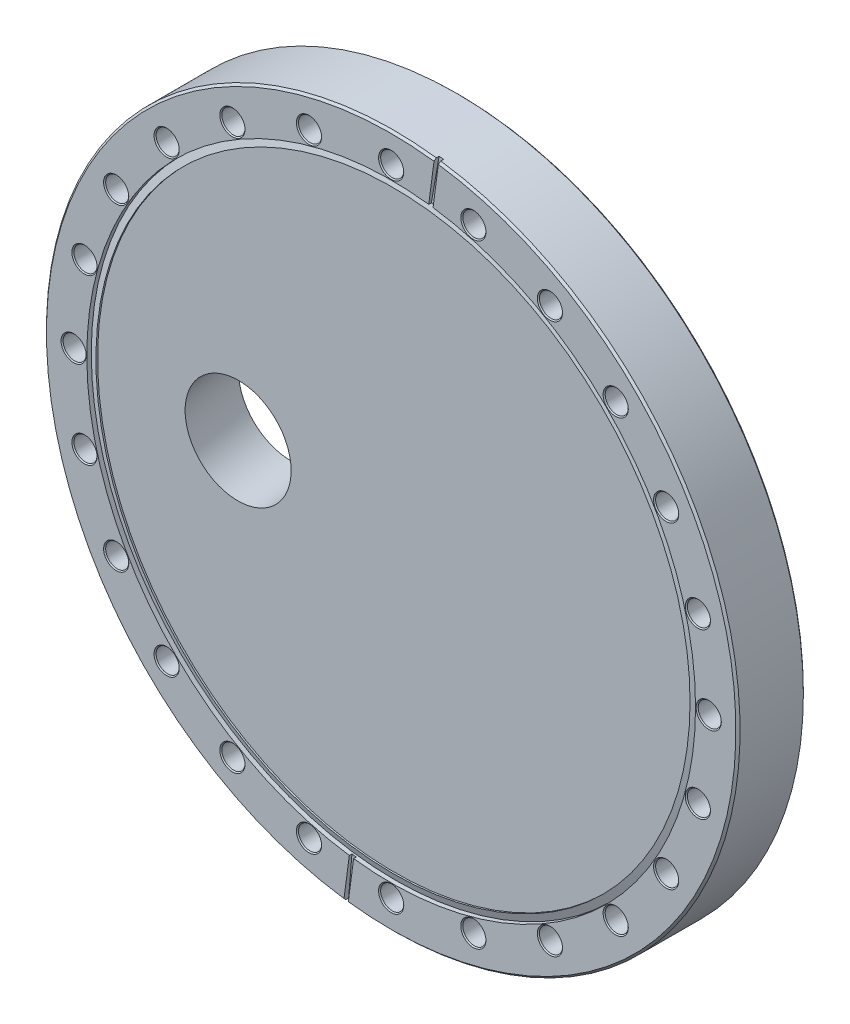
ISO-10303-21;
HEADER;
FILE_DESCRIPTION(('STEP AP214'),'2;1');
FILE_NAME('part.step','',(''),(''),'','','');
FILE_SCHEMA(('AUTOMOTIVE_DESIGN { 1 0 10303 214 1 1 1 1 }'));
ENDSEC;
DATA;
#1=APPLICATION_CONTEXT('core data for automotive mechanical design processes');
#2=APPLICATION_PROTOCOL_DEFINITION('international standard','automotive_design',2000,#1);
#3=PRODUCT_CONTEXT('',#1,'mechanical');
#4=PRODUCT('Part','Part','',(#3));
#5=PRODUCT_RELATED_PRODUCT_CATEGORY('part','',(#4));
#6=PRODUCT_DEFINITION_FORMATION('','',#4);
#7=PRODUCT_DEFINITION_CONTEXT('part definition',#1,'design');
#8=PRODUCT_DEFINITION('design','',#6,#7);
#9=PRODUCT_DEFINITION_SHAPE('','',#8);
#10=(LENGTH_UNIT() NAMED_UNIT(*) SI_UNIT(.MILLI.,.METRE.));
#11=(NAMED_UNIT(*) PLANE_ANGLE_UNIT() SI_UNIT($,.RADIAN.));
#12=(NAMED_UNIT(*) SI_UNIT($,.STERADIAN.) SOLID_ANGLE_UNIT());
#13=UNCERTAINTY_MEASURE_WITH_UNIT(LENGTH_MEASURE(1.E-05),#10,'distance_accuracy_value','');
#14=(GEOMETRIC_REPRESENTATION_CONTEXT(3) GLOBAL_UNCERTAINTY_ASSIGNED_CONTEXT((#13)) GLOBAL_UNIT_ASSIGNED_CONTEXT((#10,
#11,#12)) REPRESENTATION_CONTEXT('',''));
#15=CARTESIAN_POINT('',(0.,0.,0.));
#16=DIRECTION('',(0.,0.,1.));
#17=DIRECTION('',(1.,0.,0.));
#18=AXIS2_PLACEMENT_3D('',#15,#16,#17);
#19=CARTESIAN_POINT('',(0.,0.,-1.27));
#20=DIRECTION('',(0.,0.,1.));
#21=DIRECTION('',(1.,0.,0.));
#22=AXIS2_PLACEMENT_3D('',#19,#20,#21);
#23=PLANE('',#22);
#24=CARTESIAN_POINT('',(-57.14484361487,-0.466482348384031,-1.27));
#25=DIRECTION('',(0.,0.,1.));
#26=DIRECTION('',(0.966745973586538,0.255738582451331,0.));
#27=AXIS2_PLACEMENT_3D('',#24,#25,#26);
#28=ELLIPSE('',#27,19.3719597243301,19.0881);
#29=CARTESIAN_POINT('',(-38.4170795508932,4.48767517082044,-1.27));
#30=VERTEX_POINT('',#29);
#31=EDGE_CURVE('E719',#30,#30,#28,.T.);
#32=ORIENTED_EDGE('',*,*,#31,.F.);
#33=EDGE_LOOP('',(#32));
#34=FACE_BOUND('',#33,.T.);
#35=CARTESIAN_POINT('',(0.,0.,-1.27));
#36=DIRECTION('',(0.,0.,1.));
#37=DIRECTION('',(1.,0.,0.));
#38=AXIS2_PLACEMENT_3D('',#35,#36,#37);
#39=CIRCLE('',#38,108.458);
#40=CARTESIAN_POINT('',(108.458,0.,-1.27));
#41=VERTEX_POINT('',#40);
#42=EDGE_CURVE('E716',#41,#41,#39,.T.);
#43=ORIENTED_EDGE('',*,*,#42,.T.);
#44=EDGE_LOOP('',(#43));
#45=FACE_BOUND('',#44,.T.);
#46=ADVANCED_FACE('F34',(#34,#45),#23,.T.);
#47=CARTESIAN_POINT('',(0.,0.,-1.71266404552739));
#48=DIRECTION('',(0.,0.,1.));
#49=DIRECTION('',(1.,0.,0.));
#50=AXIS2_PLACEMENT_3D('',#47,#48,#49);
#51=CYLINDRICAL_SURFACE('',#50,108.458);
#52=ORIENTED_EDGE('',*,*,#42,.F.);
#53=EDGE_LOOP('',(#52));
#54=FACE_BOUND('',#53,.T.);
#55=CARTESIAN_POINT('',(0.,0.,-0.66039999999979));
#56=DIRECTION('',(0.,0.,-1.));
#57=DIRECTION('',(0.,-1.,0.));
#58=AXIS2_PLACEMENT_3D('',#55,#56,#57);
#59=CIRCLE('',#58,108.458);
#60=CARTESIAN_POINT('',(0.,-108.458,-0.66039999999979));
#61=VERTEX_POINT('',#60);
#62=EDGE_CURVE('E552',#61,#61,#59,.T.);
#63=ORIENTED_EDGE('',*,*,#62,.F.);
#64=EDGE_LOOP('',(#63));
#65=FACE_BOUND('',#64,.T.);
#66=ADVANCED_FACE('F895',(#54,#65),#51,.F.);
#67=CARTESIAN_POINT('',(-13.6514564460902,-109.774261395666,-0.9398));
#68=DIRECTION('',(-0.00683121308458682,-0.0518882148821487,0.998629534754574));
#69=DIRECTION('',(0.,-0.998652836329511,-0.0518894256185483));
#70=AXIS2_PLACEMENT_3D('',#67,#68,#69);
#71=PLANE('',#70);
#72=DIRECTION('',(-0.130347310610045,-0.990086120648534,-0.0523359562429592));
#73=VECTOR('',#72,1.);
#74=CARTESIAN_POINT('',(-15.2913124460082,-110.067894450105,-0.966274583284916));
#75=LINE('',#74,#73);
#76=CARTESIAN_POINT('',(-15.2913124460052,-110.067894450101,-0.966274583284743));
#77=VERTEX_POINT('',#76);
#78=CARTESIAN_POINT('',(-17.3137305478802,-125.429685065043,-1.77829889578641));
#79=VERTEX_POINT('',#78);
#80=EDGE_CURVE('E142',#77,#79,#75,.T.);
#81=ORIENTED_EDGE('',*,*,#80,.T.);
#82=CARTESIAN_POINT('',(0.,0.,4.85739132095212));
#83=DIRECTION('',(-0.00683121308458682,-0.0518882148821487,0.998629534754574));
#84=DIRECTION('',(-0.130347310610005,-0.99008612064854,-0.0523359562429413));
#85=AXIS2_PLACEMENT_3D('',#82,#83,#84);
#86=ELLIPSE('',#85,126.792765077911,126.619);
#87=CARTESIAN_POINT('',(-15.7398118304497,-125.636895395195,-1.77829889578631));
#88=VERTEX_POINT('',#87);
#89=EDGE_CURVE('E713',#79,#88,#86,.T.);
#90=ORIENTED_EDGE('',*,*,#89,.T.);
#91=DIRECTION('',(-0.130347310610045,-0.990086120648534,-0.0523359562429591));
#92=VECTOR('',#91,1.);
#93=CARTESIAN_POINT('',(-13.7173937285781,-110.27510478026,-0.966274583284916));
#94=LINE('',#93,#92);
#95=CARTESIAN_POINT('',(-13.7173937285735,-110.275104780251,-0.966274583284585));
#96=VERTEX_POINT('',#95);
#97=EDGE_CURVE('E551',#96,#88,#94,.T.);
#98=ORIENTED_EDGE('',*,*,#97,.F.);
#99=CARTESIAN_POINT('',(0.,0.,4.85739132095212));
#100=DIRECTION('',(-0.00683121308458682,-0.0518882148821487,0.998629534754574));
#101=DIRECTION('',(0.130347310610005,0.99008612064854,0.0523359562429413));
#102=AXIS2_PLACEMENT_3D('',#99,#100,#101);
#103=ELLIPSE('',#102,111.277501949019,111.125);
#104=EDGE_CURVE('E86',#96,#77,#103,.F.);
#105=ORIENTED_EDGE('',*,*,#104,.T.);
#106=EDGE_LOOP('',(#81,#90,#98,#105));
#107=FACE_BOUND('',#106,.T.);
#108=ADVANCED_FACE('F712',(#107),#71,.T.);
#109=CARTESIAN_POINT('',(15.225375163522,109.56705106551,-0.9398));
#110=DIRECTION('',(-0.00683121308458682,-0.0518882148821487,-0.998629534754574));
#111=DIRECTION('',(0.,0.998652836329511,-0.0518894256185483));
#112=AXIS2_PLACEMENT_3D('',#109,#110,#111);
#113=PLANE('',#112);
#114=CARTESIAN_POINT('',(0.,0.,4.8573913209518));
#115=DIRECTION('',(-0.00683121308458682,-0.0518882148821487,-0.998629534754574));
#116=DIRECTION('',(-0.130347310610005,-0.99008612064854,0.0523359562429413));
#117=AXIS2_PLACEMENT_3D('',#114,#115,#116);
#118=ELLIPSE('',#117,111.277501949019,111.125);
#119=CARTESIAN_POINT('',(15.2913124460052,110.067894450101,-0.966274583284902));
#120=VERTEX_POINT('',#119);
#121=CARTESIAN_POINT('',(13.7173937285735,110.275104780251,-0.966274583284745));
#122=VERTEX_POINT('',#121);
#123=EDGE_CURVE('E554',#120,#122,#118,.F.);
#124=ORIENTED_EDGE('',*,*,#123,.F.);
#125=DIRECTION('',(0.130347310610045,0.990086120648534,-0.0523359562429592));
#126=VECTOR('',#125,1.);
#127=CARTESIAN_POINT('',(15.2913124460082,110.067894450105,-0.966274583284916));
#128=LINE('',#127,#126);
#129=CARTESIAN_POINT('',(17.3137305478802,125.429685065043,-1.77829889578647));
#130=VERTEX_POINT('',#129);
#131=EDGE_CURVE('E137',#120,#130,#128,.T.);
#132=ORIENTED_EDGE('',*,*,#131,.T.);
#133=CARTESIAN_POINT('',(0.,0.,4.85739132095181));
#134=DIRECTION('',(-0.00683121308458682,-0.0518882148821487,-0.998629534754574));
#135=DIRECTION('',(0.130347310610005,0.99008612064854,-0.0523359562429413));
#136=AXIS2_PLACEMENT_3D('',#133,#134,#135);
#137=ELLIPSE('',#136,126.792765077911,126.619);
#138=CARTESIAN_POINT('',(15.7398118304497,125.636895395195,-1.77829889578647));
#139=VERTEX_POINT('',#138);
#140=EDGE_CURVE('E133',#139,#130,#137,.T.);
#141=ORIENTED_EDGE('',*,*,#140,.F.);
#142=DIRECTION('',(0.130347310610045,0.990086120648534,-0.0523359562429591));
#143=VECTOR('',#142,1.);
#144=CARTESIAN_POINT('',(13.7173937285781,110.27510478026,-0.966274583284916));
#145=LINE('',#144,#143);
#146=EDGE_CURVE('E542',#122,#139,#145,.T.);
#147=ORIENTED_EDGE('',*,*,#146,.F.);
#148=EDGE_LOOP('',(#124,#132,#141,#147));
#149=FACE_BOUND('',#148,.T.);
#150=ADVANCED_FACE('F882',(#149),#113,.F.);
#151=CARTESIAN_POINT('',(0.,0.,-1.63110861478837));
#152=DIRECTION('',(0.,0.,-1.));
#153=DIRECTION('',(-1.,0.,0.));
#154=AXIS2_PLACEMENT_3D('',#151,#152,#153);
#155=CONICAL_SURFACE('',#154,111.125,1.2217304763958);
#156=ORIENTED_EDGE('',*,*,#62,.T.);
#157=EDGE_LOOP('',(#156));
#158=FACE_BOUND('',#157,.T.);
#159=CARTESIAN_POINT('',(0.,0.,-1.63110861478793));
#160=DIRECTION('',(0.,0.,1.));
#161=DIRECTION('',(1.,0.,0.));
#162=AXIS2_PLACEMENT_3D('',#159,#160,#161);
#163=CIRCLE('',#162,111.125);
#164=CARTESIAN_POINT('',(111.125,0.,-1.63110861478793));
#165=VERTEX_POINT('',#164);
#166=EDGE_CURVE('E700',#165,#165,#163,.T.);
#167=ORIENTED_EDGE('',*,*,#166,.T.);
#168=EDGE_LOOP('',(#167));
#169=FACE_BOUND('',#168,.T.);
#170=ADVANCED_FACE('F887',(#158,#169),#155,.T.);
#171=CARTESIAN_POINT('',(0.786959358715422,-0.103605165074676,0.));
#172=DIRECTION('',(-0.991444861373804,0.130526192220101,0.));
#173=DIRECTION('',(-0.130526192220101,-0.991444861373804,0.));
#174=AXIS2_PLACEMENT_3D('',#171,#172,#173);
#175=PLANE('',#174);
#176=DIRECTION('',(0.0922968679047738,0.701064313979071,0.70709979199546));
#177=VECTOR('',#176,1.);
#178=CARTESIAN_POINT('',(-15.7398118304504,-125.6368953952,-0.762000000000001));
#179=LINE('',#178,#177);
#180=CARTESIAN_POINT('',(-15.7398118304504,-125.6368953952,-0.761999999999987));
#181=VERTEX_POINT('',#180);
#182=CARTESIAN_POINT('',(-15.6403489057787,-124.881399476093,-2.6478929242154E-12));
#183=VERTEX_POINT('',#182);
#184=EDGE_CURVE('E52',#181,#183,#179,.T.);
#185=ORIENTED_EDGE('',*,*,#184,.T.);
#186=DIRECTION('',(0.130526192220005,0.991444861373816,0.));
#187=VECTOR('',#186,1.);
#188=CARTESIAN_POINT('',(-15.6403489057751,-124.881399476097,0.));
#189=LINE('',#188,#187);
#190=CARTESIAN_POINT('',(-13.7173937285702,-110.275104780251,0.));
#191=VERTEX_POINT('',#190);
#192=EDGE_CURVE('E532',#183,#191,#189,.T.);
#193=ORIENTED_EDGE('',*,*,#192,.T.);
#194=DIRECTION('',(0.,0.,1.));
#195=VECTOR('',#194,1.);
#196=CARTESIAN_POINT('',(-13.7173937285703,-110.275104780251,-1.71266404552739));
#197=LINE('',#196,#195);
#198=EDGE_CURVE('E704',#191,#96,#197,.F.);
#199=ORIENTED_EDGE('',*,*,#198,.T.);
#200=ORIENTED_EDGE('',*,*,#97,.T.);
#201=DIRECTION('',(0.,0.,1.));
#202=VECTOR('',#201,1.);
#203=CARTESIAN_POINT('',(-15.7398118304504,-125.6368953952,0.));
#204=LINE('',#203,#202);
#205=EDGE_CURVE('E549',#88,#181,#204,.T.);
#206=ORIENTED_EDGE('',*,*,#205,.T.);
#207=EDGE_LOOP('',(#185,#193,#199,#200,#206));
#208=FACE_BOUND('',#207,.T.);
#209=ADVANCED_FACE('F197',(#208),#175,.T.);
#210=CARTESIAN_POINT('',(0.786959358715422,-0.103605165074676,0.));
#211=DIRECTION('',(0.991444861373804,-0.130526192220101,0.));
#212=DIRECTION('',(0.130526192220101,0.991444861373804,0.));
#213=AXIS2_PLACEMENT_3D('',#210,#211,#212);
#214=PLANE('',#213);
#215=DIRECTION('',(0.,0.,1.));
#216=VECTOR('',#215,1.);
#217=CARTESIAN_POINT('',(17.3137305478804,125.429685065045,0.));
#218=LINE('',#217,#216);
#219=CARTESIAN_POINT('',(17.3137305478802,125.429685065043,-0.762000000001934));
#220=VERTEX_POINT('',#219);
#221=EDGE_CURVE('E130',#130,#220,#218,.T.);
#222=ORIENTED_EDGE('',*,*,#221,.F.);
#223=ORIENTED_EDGE('',*,*,#131,.F.);
#224=DIRECTION('',(0.,0.,1.));
#225=VECTOR('',#224,1.);
#226=CARTESIAN_POINT('',(15.2913124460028,110.067894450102,-1.71266404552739));
#227=LINE('',#226,#225);
#228=CARTESIAN_POINT('',(15.2913124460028,110.067894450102,0.));
#229=VERTEX_POINT('',#228);
#230=EDGE_CURVE('E534',#120,#229,#227,.T.);
#231=ORIENTED_EDGE('',*,*,#230,.T.);
#232=DIRECTION('',(0.130526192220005,0.991444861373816,0.));
#233=VECTOR('',#232,1.);
#234=CARTESIAN_POINT('',(15.2913124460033,110.067894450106,0.));
#235=LINE('',#234,#233);
#236=CARTESIAN_POINT('',(17.2142676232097,124.674189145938,-2.67305806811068E-12));
#237=VERTEX_POINT('',#236);
#238=EDGE_CURVE('E140',#229,#237,#235,.T.);
#239=ORIENTED_EDGE('',*,*,#238,.T.);
#240=CARTESIAN_POINT('',(17.3137305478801,125.429685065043,-0.76200000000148));
#241=CARTESIAN_POINT('',(17.2971533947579,125.303769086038,-0.634999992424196));
#242=CARTESIAN_POINT('',(17.2805762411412,125.177853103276,-0.507999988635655));
#243=CARTESIAN_POINT('',(17.2474219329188,124.926021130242,-0.253999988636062));
#244=CARTESIAN_POINT('',(17.2308447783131,124.800105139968,-0.126999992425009));
#245=CARTESIAN_POINT('',(17.2142676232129,124.674189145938,-2.69892097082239E-12));
#246=B_SPLINE_CURVE_WITH_KNOTS('',3,(#240,#241,#242,#243,#244,#245),.UNSPECIFIED.,.F.,.F.,(4,2,
4),(0.,0.538820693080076,1.07764138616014),.UNSPECIFIED.);
#247=EDGE_CURVE('E122',#220,#237,#246,.T.);
#248=ORIENTED_EDGE('',*,*,#247,.F.);
#249=EDGE_LOOP('',(#222,#223,#231,#239,#248));
#250=FACE_BOUND('',#249,.T.);
#251=ADVANCED_FACE('F139',(#250),#214,.F.);
#252=CARTESIAN_POINT('',(-0.786959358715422,0.103605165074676,0.));
#253=DIRECTION('',(-0.991444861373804,0.130526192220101,0.));
#254=DIRECTION('',(-0.130526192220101,-0.991444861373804,0.));
#255=AXIS2_PLACEMENT_3D('',#252,#253,#254);
#256=PLANE('',#255);
#257=DIRECTION('',(0.,0.,1.));
#258=VECTOR('',#257,1.);
#259=CARTESIAN_POINT('',(-17.3137305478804,-125.429685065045,0.));
#260=LINE('',#259,#258);
#261=CARTESIAN_POINT('',(-17.3137305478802,-125.429685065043,-0.762000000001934));
#262=VERTEX_POINT('',#261);
#263=EDGE_CURVE('E144',#79,#262,#260,.T.);
#264=ORIENTED_EDGE('',*,*,#263,.F.);
#265=ORIENTED_EDGE('',*,*,#80,.F.);
#266=DIRECTION('',(0.,0.,1.));
#267=VECTOR('',#266,1.);
#268=CARTESIAN_POINT('',(-15.2913124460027,-110.067894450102,-1.71266404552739));
#269=LINE('',#268,#267);
#270=CARTESIAN_POINT('',(-15.2913124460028,-110.067894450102,0.));
#271=VERTEX_POINT('',#270);
#272=EDGE_CURVE('E701',#77,#271,#269,.T.);
#273=ORIENTED_EDGE('',*,*,#272,.T.);
#274=DIRECTION('',(-0.130526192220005,-0.991444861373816,0.));
#275=VECTOR('',#274,1.);
#276=CARTESIAN_POINT('',(-15.2913124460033,-110.067894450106,0.));
#277=LINE('',#276,#275);
#278=CARTESIAN_POINT('',(-17.2142676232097,-124.674189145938,-2.66934977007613E-12));
#279=VERTEX_POINT('',#278);
#280=EDGE_CURVE('E693',#271,#279,#277,.T.);
#281=ORIENTED_EDGE('',*,*,#280,.T.);
#282=CARTESIAN_POINT('',(-17.3137305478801,-125.429685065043,-0.76200000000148));
#283=CARTESIAN_POINT('',(-17.2971533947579,-125.303769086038,-0.634999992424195));
#284=CARTESIAN_POINT('',(-17.2805762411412,-125.177853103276,-0.507999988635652));
#285=CARTESIAN_POINT('',(-17.2474219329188,-124.926021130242,-0.253999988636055));
#286=CARTESIAN_POINT('',(-17.2308447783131,-124.800105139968,-0.126999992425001));
#287=CARTESIAN_POINT('',(-17.2142676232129,-124.674189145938,-2.68963946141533E-12));
#288=B_SPLINE_CURVE_WITH_KNOTS('',3,(#282,#283,#284,#285,#286,#287),.UNSPECIFIED.,.F.,.F.,(4,2,
4),(0.,0.53882069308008,1.07764138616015),.UNSPECIFIED.);
#289=EDGE_CURVE('E154',#262,#279,#288,.T.);
#290=ORIENTED_EDGE('',*,*,#289,.F.);
#291=EDGE_LOOP('',(#264,#265,#273,#281,#290));
#292=FACE_BOUND('',#291,.T.);
#293=ADVANCED_FACE('F189',(#292),#256,.F.);
#294=CARTESIAN_POINT('',(-0.786959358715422,0.103605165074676,0.));
#295=DIRECTION('',(0.991444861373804,-0.130526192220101,0.));
#296=DIRECTION('',(0.130526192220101,0.991444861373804,0.));
#297=AXIS2_PLACEMENT_3D('',#294,#295,#296);
#298=PLANE('',#297);
#299=DIRECTION('',(-0.0922968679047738,-0.701064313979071,0.70709979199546));
#300=VECTOR('',#299,1.);
#301=CARTESIAN_POINT('',(15.7398118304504,125.6368953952,-0.762000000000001));
#302=LINE('',#301,#300);
#303=CARTESIAN_POINT('',(15.7398118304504,125.6368953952,-0.761999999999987));
#304=VERTEX_POINT('',#303);
#305=CARTESIAN_POINT('',(15.6403489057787,124.881399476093,-2.64789258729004E-12));
#306=VERTEX_POINT('',#305);
#307=EDGE_CURVE('E533',#304,#306,#302,.T.);
#308=ORIENTED_EDGE('',*,*,#307,.T.);
#309=DIRECTION('',(-0.130526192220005,-0.991444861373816,0.));
#310=VECTOR('',#309,1.);
#311=CARTESIAN_POINT('',(15.6403489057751,124.881399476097,0.));
#312=LINE('',#311,#310);
#313=CARTESIAN_POINT('',(13.7173937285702,110.275104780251,0.));
#314=VERTEX_POINT('',#313);
#315=EDGE_CURVE('E531',#306,#314,#312,.T.);
#316=ORIENTED_EDGE('',*,*,#315,.T.);
#317=DIRECTION('',(0.,0.,1.));
#318=VECTOR('',#317,1.);
#319=CARTESIAN_POINT('',(13.7173937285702,110.275104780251,-1.71266404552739));
#320=LINE('',#319,#318);
#321=EDGE_CURVE('E540',#314,#122,#320,.F.);
#322=ORIENTED_EDGE('',*,*,#321,.T.);
#323=ORIENTED_EDGE('',*,*,#146,.T.);
#324=DIRECTION('',(0.,0.,1.));
#325=VECTOR('',#324,1.);
#326=CARTESIAN_POINT('',(15.7398118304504,125.6368953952,0.));
#327=LINE('',#326,#325);
#328=EDGE_CURVE('E535',#139,#304,#327,.T.);
#329=ORIENTED_EDGE('',*,*,#328,.T.);
#330=EDGE_LOOP('',(#308,#316,#322,#323,#329));
#331=FACE_BOUND('',#330,.T.);
#332=ADVANCED_FACE('F186',(#331),#298,.T.);
#333=CARTESIAN_POINT('',(0.,0.,-1.71266404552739));
#334=DIRECTION('',(0.,0.,1.));
#335=DIRECTION('',(1.,0.,0.));
#336=AXIS2_PLACEMENT_3D('',#333,#334,#335);
#337=CYLINDRICAL_SURFACE('',#336,111.125);
#338=ORIENTED_EDGE('',*,*,#166,.F.);
#339=EDGE_LOOP('',(#338));
#340=FACE_BOUND('',#339,.T.);
#341=ORIENTED_EDGE('',*,*,#198,.F.);
#342=CARTESIAN_POINT('',(0.,0.,0.));
#343=DIRECTION('',(0.,0.,1.));
#344=DIRECTION('',(1.,0.,0.));
#345=AXIS2_PLACEMENT_3D('',#342,#343,#344);
#346=CIRCLE('',#345,111.125);
#347=EDGE_CURVE('E98',#191,#229,#346,.T.);
#348=ORIENTED_EDGE('',*,*,#347,.T.);
#349=ORIENTED_EDGE('',*,*,#230,.F.);
#350=ORIENTED_EDGE('',*,*,#123,.T.);
#351=ORIENTED_EDGE('',*,*,#321,.F.);
#352=CARTESIAN_POINT('',(0.,0.,0.));
#353=DIRECTION('',(0.,0.,1.));
#354=DIRECTION('',(1.,0.,0.));
#355=AXIS2_PLACEMENT_3D('',#352,#353,#354);
#356=CIRCLE('',#355,111.125);
#357=EDGE_CURVE('E528',#314,#271,#356,.T.);
#358=ORIENTED_EDGE('',*,*,#357,.T.);
#359=ORIENTED_EDGE('',*,*,#272,.F.);
#360=ORIENTED_EDGE('',*,*,#104,.F.);
#361=EDGE_LOOP('',(#341,#348,#349,#350,#351,#358,#359,#360));
#362=FACE_BOUND('',#361,.T.);
#363=ADVANCED_FACE('F182',(#340,#362),#337,.F.);
#364=CARTESIAN_POINT('',(0.,0.,0.));
#365=DIRECTION('',(0.,0.,-1.));
#366=DIRECTION('',(-1.,0.,0.));
#367=AXIS2_PLACEMENT_3D('',#364,#365,#366);
#368=PLANE('',#367);
#369=CARTESIAN_POINT('',(0.,-115.9256,0.));
#370=DIRECTION('',(0.,0.,1.));
#371=DIRECTION('',(1.,0.,0.));
#372=AXIS2_PLACEMENT_3D('',#369,#370,#371);
#373=CIRCLE('',#372,4.59740000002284);
#374=CARTESIAN_POINT('',(4.59740000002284,-115.9256,0.));
#375=VERTEX_POINT('',#374);
#376=EDGE_CURVE('E661',#375,#375,#373,.F.);
#377=ORIENTED_EDGE('',*,*,#376,.T.);
#378=EDGE_LOOP('',(#377));
#379=FACE_BOUND('',#378,.T.);
#380=CARTESIAN_POINT('',(30.0037530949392,-111.975530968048,0.));
#381=DIRECTION('',(0.,0.,1.));
#382=DIRECTION('',(1.,0.,0.));
#383=AXIS2_PLACEMENT_3D('',#380,#381,#382);
#384=CIRCLE('',#383,4.59739999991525);
#385=CARTESIAN_POINT('',(34.6011530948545,-111.975530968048,0.));
#386=VERTEX_POINT('',#385);
#387=EDGE_CURVE('E664',#386,#386,#384,.F.);
#388=ORIENTED_EDGE('',*,*,#387,.T.);
#389=EDGE_LOOP('',(#388));
#390=FACE_BOUND('',#389,.T.);
#391=CARTESIAN_POINT('',(57.9628,-100.394514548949,5.6843418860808E-11));
#392=DIRECTION('',(0.,0.,1.));
#393=DIRECTION('',(1.,0.,0.));
#394=AXIS2_PLACEMENT_3D('',#391,#392,#393);
#395=CIRCLE('',#394,4.59740000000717);
#396=CARTESIAN_POINT('',(62.5602000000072,-100.394514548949,5.6843418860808E-11));
#397=VERTEX_POINT('',#396);
#398=EDGE_CURVE('E667',#397,#397,#395,.F.);
#399=ORIENTED_EDGE('',*,*,#398,.T.);
#400=EDGE_LOOP('',(#399));
#401=FACE_BOUND('',#400,.T.);
#402=CARTESIAN_POINT('',(81.971777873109,-81.971777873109,0.));
#403=DIRECTION('',(0.,0.,1.));
#404=DIRECTION('',(1.,0.,0.));
#405=AXIS2_PLACEMENT_3D('',#402,#403,#404);
#406=CIRCLE('',#405,4.59739999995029);
#407=CARTESIAN_POINT('',(86.5691778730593,-81.971777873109,0.));
#408=VERTEX_POINT('',#407);
#409=EDGE_CURVE('E670',#408,#408,#406,.F.);
#410=ORIENTED_EDGE('',*,*,#409,.T.);
#411=EDGE_LOOP('',(#410));
#412=FACE_BOUND('',#411,.T.);
#413=CARTESIAN_POINT('',(100.394514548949,-57.9628,0.));
#414=DIRECTION('',(0.,0.,1.));
#415=DIRECTION('',(1.,0.,0.));
#416=AXIS2_PLACEMENT_3D('',#413,#414,#415);
#417=CIRCLE('',#416,4.59740000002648);
#418=CARTESIAN_POINT('',(104.991914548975,-57.9628,0.));
#419=VERTEX_POINT('',#418);
#420=EDGE_CURVE('E673',#419,#419,#417,.F.);
#421=ORIENTED_EDGE('',*,*,#420,.T.);
#422=EDGE_LOOP('',(#421));
#423=FACE_BOUND('',#422,.T.);
#424=CARTESIAN_POINT('',(111.975530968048,-30.0037530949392,0.));
#425=DIRECTION('',(0.,0.,1.));
#426=DIRECTION('',(1.,0.,0.));
#427=AXIS2_PLACEMENT_3D('',#424,#425,#426);
#428=CIRCLE('',#427,4.5973999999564);
#429=CARTESIAN_POINT('',(116.572930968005,-30.0037530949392,0.));
#430=VERTEX_POINT('',#429);
#431=EDGE_CURVE('E676',#430,#430,#428,.F.);
#432=ORIENTED_EDGE('',*,*,#431,.T.);
#433=EDGE_LOOP('',(#432));
#434=FACE_BOUND('',#433,.T.);
#435=CARTESIAN_POINT('',(115.9256,0.,0.));
#436=DIRECTION('',(0.,0.,1.));
#437=DIRECTION('',(1.,0.,0.));
#438=AXIS2_PLACEMENT_3D('',#435,#436,#437);
#439=CIRCLE('',#438,4.59740000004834);
#440=CARTESIAN_POINT('',(120.523000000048,0.,0.));
#441=VERTEX_POINT('',#440);
#442=EDGE_CURVE('E679',#441,#441,#439,.F.);
#443=ORIENTED_EDGE('',*,*,#442,.T.);
#444=EDGE_LOOP('',(#443));
#445=FACE_BOUND('',#444,.T.);
#446=CARTESIAN_POINT('',(111.975530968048,30.0037530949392,0.));
#447=DIRECTION('',(0.,0.,1.));
#448=DIRECTION('',(1.,0.,0.));
#449=AXIS2_PLACEMENT_3D('',#446,#447,#448);
#450=CIRCLE('',#449,4.5973999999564);
#451=CARTESIAN_POINT('',(116.572930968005,30.0037530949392,0.));
#452=VERTEX_POINT('',#451);
#453=EDGE_CURVE('E682',#452,#452,#450,.F.);
#454=ORIENTED_EDGE('',*,*,#453,.T.);
#455=EDGE_LOOP('',(#454));
#456=FACE_BOUND('',#455,.T.);
#457=CARTESIAN_POINT('',(100.394514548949,57.9628,0.));
#458=DIRECTION('',(0.,0.,1.));
#459=DIRECTION('',(1.,0.,0.));
#460=AXIS2_PLACEMENT_3D('',#457,#458,#459);
#461=CIRCLE('',#460,4.59740000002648);
#462=CARTESIAN_POINT('',(104.991914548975,57.9628,0.));
#463=VERTEX_POINT('',#462);
#464=EDGE_CURVE('E685',#463,#463,#461,.F.);
#465=ORIENTED_EDGE('',*,*,#464,.T.);
#466=EDGE_LOOP('',(#465));
#467=FACE_BOUND('',#466,.T.);
#468=CARTESIAN_POINT('',(81.971777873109,81.971777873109,0.));
#469=DIRECTION('',(0.,0.,1.));
#470=DIRECTION('',(1.,0.,0.));
#471=AXIS2_PLACEMENT_3D('',#468,#469,#470);
#472=CIRCLE('',#471,4.59739999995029);
#473=CARTESIAN_POINT('',(86.5691778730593,81.971777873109,0.));
#474=VERTEX_POINT('',#473);
#475=EDGE_CURVE('E517',#474,#474,#472,.F.);
#476=ORIENTED_EDGE('',*,*,#475,.T.);
#477=EDGE_LOOP('',(#476));
#478=FACE_BOUND('',#477,.T.);
#479=CARTESIAN_POINT('',(57.9628,100.394514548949,5.6843418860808E-11));
#480=DIRECTION('',(0.,0.,1.));
#481=DIRECTION('',(1.,0.,0.));
#482=AXIS2_PLACEMENT_3D('',#479,#480,#481);
#483=CIRCLE('',#482,4.59740000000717);
#484=CARTESIAN_POINT('',(62.5602000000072,100.394514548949,5.6843418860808E-11));
#485=VERTEX_POINT('',#484);
#486=EDGE_CURVE('E513',#485,#485,#483,.F.);
#487=ORIENTED_EDGE('',*,*,#486,.T.);
#488=EDGE_LOOP('',(#487));
#489=FACE_BOUND('',#488,.T.);
#490=CARTESIAN_POINT('',(30.0037530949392,111.975530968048,0.));
#491=DIRECTION('',(0.,0.,1.));
#492=DIRECTION('',(1.,0.,0.));
#493=AXIS2_PLACEMENT_3D('',#490,#491,#492);
#494=CIRCLE('',#493,4.59739999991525);
#495=CARTESIAN_POINT('',(34.6011530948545,111.975530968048,0.));
#496=VERTEX_POINT('',#495);
#497=EDGE_CURVE('E511',#496,#496,#494,.F.);
#498=ORIENTED_EDGE('',*,*,#497,.T.);
#499=EDGE_LOOP('',(#498));
#500=FACE_BOUND('',#499,.T.);
#501=ORIENTED_EDGE('',*,*,#238,.F.);
#502=ORIENTED_EDGE('',*,*,#347,.F.);
#503=ORIENTED_EDGE('',*,*,#192,.F.);
#504=CARTESIAN_POINT('',(0.,0.,-2.6478385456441E-12));
#505=DIRECTION('',(0.,0.,-1.));
#506=DIRECTION('',(-1.,0.,0.));
#507=AXIS2_PLACEMENT_3D('',#504,#505,#506);
#508=CIRCLE('',#507,125.857000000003);
#509=EDGE_CURVE('E520',#237,#183,#508,.T.);
#510=ORIENTED_EDGE('',*,*,#509,.F.);
#511=EDGE_LOOP('',(#501,#502,#503,#510));
#512=FACE_BOUND('',#511,.T.);
#513=ADVANCED_FACE('F178',(#379,#390,#401,#412,#423,#434,#445,#456,#467,#478,#489,#500,#512),
#368,.F.);
#514=CARTESIAN_POINT('',(0.,0.,0.));
#515=DIRECTION('',(0.,0.,-1.));
#516=DIRECTION('',(-1.,0.,0.));
#517=AXIS2_PLACEMENT_3D('',#514,#515,#516);
#518=PLANE('',#517);
#519=CARTESIAN_POINT('',(-30.0037530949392,111.975530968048,5.6843418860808E-11));
#520=DIRECTION('',(0.,0.,1.));
#521=DIRECTION('',(1.,0.,0.));
#522=AXIS2_PLACEMENT_3D('',#519,#520,#521);
#523=CIRCLE('',#522,4.59739999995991);
#524=CARTESIAN_POINT('',(-25.4063530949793,111.975530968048,5.6843418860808E-11));
#525=VERTEX_POINT('',#524);
#526=EDGE_CURVE('E628',#525,#525,#523,.F.);
#527=ORIENTED_EDGE('',*,*,#526,.T.);
#528=EDGE_LOOP('',(#527));
#529=FACE_BOUND('',#528,.T.);
#530=CARTESIAN_POINT('',(-57.9628,100.394514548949,5.6843418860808E-11));
#531=DIRECTION('',(0.,0.,1.));
#532=DIRECTION('',(1.,0.,0.));
#533=AXIS2_PLACEMENT_3D('',#530,#531,#532);
#534=CIRCLE('',#533,4.59739999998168);
#535=CARTESIAN_POINT('',(-53.3654000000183,100.394514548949,5.6843418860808E-11));
#536=VERTEX_POINT('',#535);
#537=EDGE_CURVE('E631',#536,#536,#534,.F.);
#538=ORIENTED_EDGE('',*,*,#537,.T.);
#539=EDGE_LOOP('',(#538));
#540=FACE_BOUND('',#539,.T.);
#541=CARTESIAN_POINT('',(-81.971777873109,81.971777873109,-5.6843418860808E-11));
#542=DIRECTION('',(0.,0.,1.));
#543=DIRECTION('',(1.,0.,0.));
#544=AXIS2_PLACEMENT_3D('',#541,#542,#543);
#545=CIRCLE('',#544,4.59739999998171);
#546=CARTESIAN_POINT('',(-77.3743778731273,81.971777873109,-5.6843418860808E-11));
#547=VERTEX_POINT('',#546);
#548=EDGE_CURVE('E634',#547,#547,#545,.F.);
#549=ORIENTED_EDGE('',*,*,#548,.T.);
#550=EDGE_LOOP('',(#549));
#551=FACE_BOUND('',#550,.T.);
#552=CARTESIAN_POINT('',(-100.394514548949,57.9628,-5.6843418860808E-11));
#553=DIRECTION('',(0.,0.,1.));
#554=DIRECTION('',(1.,0.,0.));
#555=AXIS2_PLACEMENT_3D('',#552,#553,#554);
#556=CIRCLE('',#555,4.59739999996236);
#557=CARTESIAN_POINT('',(-95.7971145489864,57.9628,-5.6843418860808E-11));
#558=VERTEX_POINT('',#557);
#559=EDGE_CURVE('E637',#558,#558,#556,.F.);
#560=ORIENTED_EDGE('',*,*,#559,.T.);
#561=EDGE_LOOP('',(#560));
#562=FACE_BOUND('',#561,.T.);
#563=CARTESIAN_POINT('',(-111.975530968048,30.0037530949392,-5.6843418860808E-11));
#564=DIRECTION('',(0.,0.,1.));
#565=DIRECTION('',(1.,0.,0.));
#566=AXIS2_PLACEMENT_3D('',#563,#564,#565);
#567=CIRCLE('',#566,4.5973999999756);
#568=CARTESIAN_POINT('',(-107.378130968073,30.0037530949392,-5.6843418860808E-11));
#569=VERTEX_POINT('',#568);
#570=EDGE_CURVE('E640',#569,#569,#567,.F.);
#571=ORIENTED_EDGE('',*,*,#570,.T.);
#572=EDGE_LOOP('',(#571));
#573=FACE_BOUND('',#572,.T.);
#574=CARTESIAN_POINT('',(-115.9256,0.,-5.6843418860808E-11));
#575=DIRECTION('',(0.,0.,1.));
#576=DIRECTION('',(1.,0.,0.));
#577=AXIS2_PLACEMENT_3D('',#574,#575,#576);
#578=CIRCLE('',#577,4.59739999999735);
#579=CARTESIAN_POINT('',(-111.328200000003,0.,-5.6843418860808E-11));
#580=VERTEX_POINT('',#579);
#581=EDGE_CURVE('E643',#580,#580,#578,.F.);
#582=ORIENTED_EDGE('',*,*,#581,.T.);
#583=EDGE_LOOP('',(#582));
#584=FACE_BOUND('',#583,.T.);
#585=CARTESIAN_POINT('',(-111.975530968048,-30.0037530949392,-5.6843418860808E-11));
#586=DIRECTION('',(0.,0.,1.));
#587=DIRECTION('',(1.,0.,0.));
#588=AXIS2_PLACEMENT_3D('',#585,#586,#587);
#589=CIRCLE('',#588,4.5973999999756);
#590=CARTESIAN_POINT('',(-107.378130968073,-30.0037530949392,-5.6843418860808E-11));
#591=VERTEX_POINT('',#590);
#592=EDGE_CURVE('E646',#591,#591,#589,.F.);
#593=ORIENTED_EDGE('',*,*,#592,.T.);
#594=EDGE_LOOP('',(#593));
#595=FACE_BOUND('',#594,.T.);
#596=CARTESIAN_POINT('',(-100.394514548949,-57.9628,-5.6843418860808E-11));
#597=DIRECTION('',(0.,0.,1.));
#598=DIRECTION('',(1.,0.,0.));
#599=AXIS2_PLACEMENT_3D('',#596,#597,#598);
#600=CIRCLE('',#599,4.59739999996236);
#601=CARTESIAN_POINT('',(-95.7971145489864,-57.9628,-5.6843418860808E-11));
#602=VERTEX_POINT('',#601);
#603=EDGE_CURVE('E649',#602,#602,#600,.F.);
#604=ORIENTED_EDGE('',*,*,#603,.T.);
#605=EDGE_LOOP('',(#604));
#606=FACE_BOUND('',#605,.T.);
#607=CARTESIAN_POINT('',(-81.971777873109,-81.971777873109,-5.6843418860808E-11));
#608=DIRECTION('',(0.,0.,1.));
#609=DIRECTION('',(1.,0.,0.));
#610=AXIS2_PLACEMENT_3D('',#607,#608,#609);
#611=CIRCLE('',#610,4.59739999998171);
#612=CARTESIAN_POINT('',(-77.3743778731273,-81.971777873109,-5.6843418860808E-11));
#613=VERTEX_POINT('',#612);
#614=EDGE_CURVE('E652',#613,#613,#611,.F.);
#615=ORIENTED_EDGE('',*,*,#614,.T.);
#616=EDGE_LOOP('',(#615));
#617=FACE_BOUND('',#616,.T.);
#618=CARTESIAN_POINT('',(-57.9628,-100.394514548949,5.6843418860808E-11));
#619=DIRECTION('',(0.,0.,1.));
#620=DIRECTION('',(1.,0.,0.));
#621=AXIS2_PLACEMENT_3D('',#618,#619,#620);
#622=CIRCLE('',#621,4.59739999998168);
#623=CARTESIAN_POINT('',(-53.3654000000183,-100.394514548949,5.6843418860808E-11));
#624=VERTEX_POINT('',#623);
#625=EDGE_CURVE('E655',#624,#624,#622,.F.);
#626=ORIENTED_EDGE('',*,*,#625,.T.);
#627=EDGE_LOOP('',(#626));
#628=FACE_BOUND('',#627,.T.);
#629=CARTESIAN_POINT('',(-30.0037530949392,-111.975530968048,5.6843418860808E-11));
#630=DIRECTION('',(0.,0.,1.));
#631=DIRECTION('',(1.,0.,0.));
#632=AXIS2_PLACEMENT_3D('',#629,#630,#631);
#633=CIRCLE('',#632,4.59739999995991);
#634=CARTESIAN_POINT('',(-25.4063530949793,-111.975530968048,5.6843418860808E-11));
#635=VERTEX_POINT('',#634);
#636=EDGE_CURVE('E658',#635,#635,#633,.F.);
#637=ORIENTED_EDGE('',*,*,#636,.T.);
#638=EDGE_LOOP('',(#637));
#639=FACE_BOUND('',#638,.T.);
#640=CARTESIAN_POINT('',(0.,115.9256,0.));
#641=DIRECTION('',(0.,0.,1.));
#642=DIRECTION('',(1.,0.,0.));
#643=AXIS2_PLACEMENT_3D('',#640,#641,#642);
#644=CIRCLE('',#643,4.59740000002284);
#645=CARTESIAN_POINT('',(4.59740000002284,115.9256,0.));
#646=VERTEX_POINT('',#645);
#647=EDGE_CURVE('E514',#646,#646,#644,.F.);
#648=ORIENTED_EDGE('',*,*,#647,.T.);
#649=EDGE_LOOP('',(#648));
#650=FACE_BOUND('',#649,.T.);
#651=ORIENTED_EDGE('',*,*,#357,.F.);
#652=ORIENTED_EDGE('',*,*,#315,.F.);
#653=CARTESIAN_POINT('',(0.,0.,-2.6478385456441E-12));
#654=DIRECTION('',(0.,0.,-1.));
#655=DIRECTION('',(-1.,0.,0.));
#656=AXIS2_PLACEMENT_3D('',#653,#654,#655);
#657=CIRCLE('',#656,125.857000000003);
#658=EDGE_CURVE('E525',#279,#306,#657,.T.);
#659=ORIENTED_EDGE('',*,*,#658,.F.);
#660=ORIENTED_EDGE('',*,*,#280,.F.);
#661=EDGE_LOOP('',(#651,#652,#659,#660));
#662=FACE_BOUND('',#661,.T.);
#663=ADVANCED_FACE('F174',(#529,#540,#551,#562,#573,#584,#595,#606,#617,#628,#639,#650,#662),
#518,.F.);
#664=CARTESIAN_POINT('',(0.,0.,-0.762000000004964));
#665=DIRECTION('',(0.,0.,-1.));
#666=DIRECTION('',(-1.,0.,0.));
#667=AXIS2_PLACEMENT_3D('',#664,#665,#666);
#668=CONICAL_SURFACE('',#667,126.619000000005,0.785398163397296);
#669=CARTESIAN_POINT('',(0.,0.,-0.762));
#670=DIRECTION('',(0.,0.,-1.));
#671=DIRECTION('',(-1.,0.,0.));
#672=AXIS2_PLACEMENT_3D('',#669,#670,#671);
#673=CIRCLE('',#672,126.619);
#674=EDGE_CURVE('E127',#262,#304,#673,.T.);
#675=ORIENTED_EDGE('',*,*,#674,.F.);
#676=ORIENTED_EDGE('',*,*,#289,.T.);
#677=ORIENTED_EDGE('',*,*,#658,.T.);
#678=ORIENTED_EDGE('',*,*,#307,.F.);
#679=EDGE_LOOP('',(#675,#676,#677,#678));
#680=FACE_BOUND('',#679,.T.);
#681=ADVANCED_FACE('F169',(#680),#668,.T.);
#682=CARTESIAN_POINT('',(0.,0.,-0.762000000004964));
#683=DIRECTION('',(0.,0.,-1.));
#684=DIRECTION('',(-1.,0.,0.));
#685=AXIS2_PLACEMENT_3D('',#682,#683,#684);
#686=CONICAL_SURFACE('',#685,126.619000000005,0.785398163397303);
#687=ORIENTED_EDGE('',*,*,#509,.T.);
#688=ORIENTED_EDGE('',*,*,#184,.F.);
#689=CARTESIAN_POINT('',(0.,0.,-0.762));
#690=DIRECTION('',(0.,0.,-1.));
#691=DIRECTION('',(-1.,0.,0.));
#692=AXIS2_PLACEMENT_3D('',#689,#690,#691);
#693=CIRCLE('',#692,126.619);
#694=EDGE_CURVE('E117',#220,#181,#693,.T.);
#695=ORIENTED_EDGE('',*,*,#694,.F.);
#696=ORIENTED_EDGE('',*,*,#247,.T.);
#697=EDGE_LOOP('',(#687,#688,#695,#696));
#698=FACE_BOUND('',#697,.T.);
#699=ADVANCED_FACE('F120',(#698),#686,.T.);
#700=CARTESIAN_POINT('',(0.,115.9256,0.));
#701=DIRECTION('',(0.,0.,1.));
#702=DIRECTION('',(1.,0.,0.));
#703=AXIS2_PLACEMENT_3D('',#700,#701,#702);
#704=CONICAL_SURFACE('',#703,4.59740000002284,0.785398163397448);
#705=CARTESIAN_POINT('',(0.,115.9256,-0.381));
#706=DIRECTION('',(0.,0.,-1.));
#707=DIRECTION('',(-1.,0.,0.));
#708=AXIS2_PLACEMENT_3D('',#705,#706,#707);
#709=CIRCLE('',#708,4.2164);
#710=CARTESIAN_POINT('',(-4.2164,115.9256,-0.381));
#711=VERTEX_POINT('',#710);
#712=EDGE_CURVE('E126',#711,#711,#709,.T.);
#713=ORIENTED_EDGE('',*,*,#712,.T.);
#714=EDGE_LOOP('',(#713));
#715=FACE_BOUND('',#714,.T.);
#716=ORIENTED_EDGE('',*,*,#647,.F.);
#717=EDGE_LOOP('',(#716));
#718=FACE_BOUND('',#717,.T.);
#719=ADVANCED_FACE('F168',(#715,#718),#704,.F.);
#720=CARTESIAN_POINT('',(30.0037530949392,111.975530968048,0.));
#721=DIRECTION('',(0.,0.,1.));
#722=DIRECTION('',(1.,0.,0.));
#723=AXIS2_PLACEMENT_3D('',#720,#721,#722);
#724=CONICAL_SURFACE('',#723,4.59739999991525,0.785398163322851);
#725=CARTESIAN_POINT('',(30.0037530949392,111.975530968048,-0.381));
#726=DIRECTION('',(0.,0.,-1.));
#727=DIRECTION('',(-1.,0.,0.));
#728=AXIS2_PLACEMENT_3D('',#725,#726,#727);
#729=CIRCLE('',#728,4.2164);
#730=CARTESIAN_POINT('',(25.7873530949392,111.975530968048,-0.381));
#731=VERTEX_POINT('',#730);
#732=EDGE_CURVE('E508',#731,#731,#729,.T.);
#733=ORIENTED_EDGE('',*,*,#732,.T.);
#734=EDGE_LOOP('',(#733));
#735=FACE_BOUND('',#734,.T.);
#736=ORIENTED_EDGE('',*,*,#497,.F.);
#737=EDGE_LOOP('',(#736));
#738=FACE_BOUND('',#737,.T.);
#739=ADVANCED_FACE('F497',(#735,#738),#724,.F.);
#740=CARTESIAN_POINT('',(57.9628,100.394514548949,5.6843418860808E-11));
#741=DIRECTION('',(0.,0.,1.));
#742=DIRECTION('',(1.,0.,0.));
#743=AXIS2_PLACEMENT_3D('',#740,#741,#742);
#744=CONICAL_SURFACE('',#743,4.59740000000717,0.785398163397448);
#745=CARTESIAN_POINT('',(57.9628,100.394514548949,-0.381));
#746=DIRECTION('',(0.,0.,-1.));
#747=DIRECTION('',(-1.,0.,0.));
#748=AXIS2_PLACEMENT_3D('',#745,#746,#747);
#749=CIRCLE('',#748,4.2164);
#750=CARTESIAN_POINT('',(53.7464,100.394514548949,-0.381));
#751=VERTEX_POINT('',#750);
#752=EDGE_CURVE('E864',#751,#751,#749,.T.);
#753=ORIENTED_EDGE('',*,*,#752,.T.);
#754=EDGE_LOOP('',(#753));
#755=FACE_BOUND('',#754,.T.);
#756=ORIENTED_EDGE('',*,*,#486,.F.);
#757=EDGE_LOOP('',(#756));
#758=FACE_BOUND('',#757,.T.);
#759=ADVANCED_FACE('F494',(#755,#758),#744,.F.);
#760=CARTESIAN_POINT('',(81.971777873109,81.971777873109,0.));
#761=DIRECTION('',(0.,0.,1.));
#762=DIRECTION('',(1.,0.,0.));
#763=AXIS2_PLACEMENT_3D('',#760,#761,#762);
#764=CONICAL_SURFACE('',#763,4.59739999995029,0.785398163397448);
#765=CARTESIAN_POINT('',(81.971777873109,81.971777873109,-0.381));
#766=DIRECTION('',(0.,0.,-1.));
#767=DIRECTION('',(-1.,0.,0.));
#768=AXIS2_PLACEMENT_3D('',#765,#766,#767);
#769=CIRCLE('',#768,4.2164);
#770=CARTESIAN_POINT('',(77.755377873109,81.971777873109,-0.381));
#771=VERTEX_POINT('',#770);
#772=EDGE_CURVE('E861',#771,#771,#769,.T.);
#773=ORIENTED_EDGE('',*,*,#772,.T.);
#774=EDGE_LOOP('',(#773));
#775=FACE_BOUND('',#774,.T.);
#776=ORIENTED_EDGE('',*,*,#475,.F.);
#777=EDGE_LOOP('',(#776));
#778=FACE_BOUND('',#777,.T.);
#779=ADVANCED_FACE('F490',(#775,#778),#764,.F.);
#780=CARTESIAN_POINT('',(100.394514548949,57.9628,-5.6843418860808E-11));
#781=DIRECTION('',(0.,0.,1.));
#782=DIRECTION('',(1.,0.,0.));
#783=AXIS2_PLACEMENT_3D('',#780,#781,#782);
#784=CONICAL_SURFACE('',#783,4.59739999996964,0.785398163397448);
#785=CARTESIAN_POINT('',(100.394514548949,57.9628,-0.381));
#786=DIRECTION('',(0.,0.,-1.));
#787=DIRECTION('',(-1.,0.,0.));
#788=AXIS2_PLACEMENT_3D('',#785,#786,#787);
#789=CIRCLE('',#788,4.2164);
#790=CARTESIAN_POINT('',(96.1781145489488,57.9628,-0.381));
#791=VERTEX_POINT('',#790);
#792=EDGE_CURVE('E858',#791,#791,#789,.T.);
#793=ORIENTED_EDGE('',*,*,#792,.T.);
#794=EDGE_LOOP('',(#793));
#795=FACE_BOUND('',#794,.T.);
#796=ORIENTED_EDGE('',*,*,#464,.F.);
#797=EDGE_LOOP('',(#796));
#798=FACE_BOUND('',#797,.T.);
#799=ADVANCED_FACE('F486',(#795,#798),#784,.F.);
#800=CARTESIAN_POINT('',(111.975530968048,30.0037530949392,-5.6843418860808E-11));
#801=DIRECTION('',(0.,0.,1.));
#802=DIRECTION('',(1.,0.,0.));
#803=AXIS2_PLACEMENT_3D('',#800,#801,#802);
#804=CONICAL_SURFACE('',#803,4.59739999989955,0.785398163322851);
#805=CARTESIAN_POINT('',(111.975530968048,30.0037530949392,-0.381));
#806=DIRECTION('',(0.,0.,-1.));
#807=DIRECTION('',(-1.,0.,0.));
#808=AXIS2_PLACEMENT_3D('',#805,#806,#807);
#809=CIRCLE('',#808,4.2164);
#810=CARTESIAN_POINT('',(107.759130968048,30.0037530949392,-0.381));
#811=VERTEX_POINT('',#810);
#812=EDGE_CURVE('E855',#811,#811,#809,.T.);
#813=ORIENTED_EDGE('',*,*,#812,.T.);
#814=EDGE_LOOP('',(#813));
#815=FACE_BOUND('',#814,.T.);
#816=ORIENTED_EDGE('',*,*,#453,.F.);
#817=EDGE_LOOP('',(#816));
#818=FACE_BOUND('',#817,.T.);
#819=ADVANCED_FACE('F482',(#815,#818),#804,.F.);
#820=CARTESIAN_POINT('',(115.9256,0.,-5.6843418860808E-11));
#821=DIRECTION('',(0.,0.,1.));
#822=DIRECTION('',(1.,0.,0.));
#823=AXIS2_PLACEMENT_3D('',#820,#821,#822);
#824=CONICAL_SURFACE('',#823,4.59739999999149,0.785398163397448);
#825=CARTESIAN_POINT('',(115.9256,0.,-0.381));
#826=DIRECTION('',(0.,0.,-1.));
#827=DIRECTION('',(-1.,0.,0.));
#828=AXIS2_PLACEMENT_3D('',#825,#826,#827);
#829=CIRCLE('',#828,4.2164);
#830=CARTESIAN_POINT('',(111.7092,0.,-0.381));
#831=VERTEX_POINT('',#830);
#832=EDGE_CURVE('E852',#831,#831,#829,.T.);
#833=ORIENTED_EDGE('',*,*,#832,.T.);
#834=EDGE_LOOP('',(#833));
#835=FACE_BOUND('',#834,.T.);
#836=ORIENTED_EDGE('',*,*,#442,.F.);
#837=EDGE_LOOP('',(#836));
#838=FACE_BOUND('',#837,.T.);
#839=ADVANCED_FACE('F478',(#835,#838),#824,.F.);
#840=CARTESIAN_POINT('',(111.975530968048,-30.0037530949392,-5.6843418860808E-11));
#841=DIRECTION('',(0.,0.,1.));
#842=DIRECTION('',(1.,0.,0.));
#843=AXIS2_PLACEMENT_3D('',#840,#841,#842);
#844=CONICAL_SURFACE('',#843,4.59739999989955,0.785398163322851);
#845=CARTESIAN_POINT('',(111.975530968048,-30.0037530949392,-0.381));
#846=DIRECTION('',(0.,0.,-1.));
#847=DIRECTION('',(-1.,0.,0.));
#848=AXIS2_PLACEMENT_3D('',#845,#846,#847);
#849=CIRCLE('',#848,4.2164);
#850=CARTESIAN_POINT('',(107.759130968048,-30.0037530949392,-0.381));
#851=VERTEX_POINT('',#850);
#852=EDGE_CURVE('E849',#851,#851,#849,.T.);
#853=ORIENTED_EDGE('',*,*,#852,.T.);
#854=EDGE_LOOP('',(#853));
#855=FACE_BOUND('',#854,.T.);
#856=ORIENTED_EDGE('',*,*,#431,.F.);
#857=EDGE_LOOP('',(#856));
#858=FACE_BOUND('',#857,.T.);
#859=ADVANCED_FACE('F474',(#855,#858),#844,.F.);
#860=CARTESIAN_POINT('',(100.394514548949,-57.9628,-5.6843418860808E-11));
#861=DIRECTION('',(0.,0.,1.));
#862=DIRECTION('',(1.,0.,0.));
#863=AXIS2_PLACEMENT_3D('',#860,#861,#862);
#864=CONICAL_SURFACE('',#863,4.59739999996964,0.785398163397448);
#865=CARTESIAN_POINT('',(100.394514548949,-57.9628,-0.381));
#866=DIRECTION('',(0.,0.,-1.));
#867=DIRECTION('',(-1.,0.,0.));
#868=AXIS2_PLACEMENT_3D('',#865,#866,#867);
#869=CIRCLE('',#868,4.2164);
#870=CARTESIAN_POINT('',(96.1781145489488,-57.9628,-0.381));
#871=VERTEX_POINT('',#870);
#872=EDGE_CURVE('E846',#871,#871,#869,.T.);
#873=ORIENTED_EDGE('',*,*,#872,.T.);
#874=EDGE_LOOP('',(#873));
#875=FACE_BOUND('',#874,.T.);
#876=ORIENTED_EDGE('',*,*,#420,.F.);
#877=EDGE_LOOP('',(#876));
#878=FACE_BOUND('',#877,.T.);
#879=ADVANCED_FACE('F470',(#875,#878),#864,.F.);
#880=CARTESIAN_POINT('',(81.971777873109,-81.971777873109,0.));
#881=DIRECTION('',(0.,0.,1.));
#882=DIRECTION('',(1.,0.,0.));
#883=AXIS2_PLACEMENT_3D('',#880,#881,#882);
#884=CONICAL_SURFACE('',#883,4.59739999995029,0.785398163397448);
#885=CARTESIAN_POINT('',(81.971777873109,-81.971777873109,-0.381));
#886=DIRECTION('',(0.,0.,-1.));
#887=DIRECTION('',(-1.,0.,0.));
#888=AXIS2_PLACEMENT_3D('',#885,#886,#887);
#889=CIRCLE('',#888,4.2164);
#890=CARTESIAN_POINT('',(77.755377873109,-81.971777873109,-0.381));
#891=VERTEX_POINT('',#890);
#892=EDGE_CURVE('E843',#891,#891,#889,.T.);
#893=ORIENTED_EDGE('',*,*,#892,.T.);
#894=EDGE_LOOP('',(#893));
#895=FACE_BOUND('',#894,.T.);
#896=ORIENTED_EDGE('',*,*,#409,.F.);
#897=EDGE_LOOP('',(#896));
#898=FACE_BOUND('',#897,.T.);
#899=ADVANCED_FACE('F466',(#895,#898),#884,.F.);
#900=CARTESIAN_POINT('',(57.9628,-100.394514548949,5.6843418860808E-11));
#901=DIRECTION('',(0.,0.,1.));
#902=DIRECTION('',(1.,0.,0.));
#903=AXIS2_PLACEMENT_3D('',#900,#901,#902);
#904=CONICAL_SURFACE('',#903,4.59740000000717,0.785398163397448);
#905=CARTESIAN_POINT('',(57.9628,-100.394514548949,-0.381));
#906=DIRECTION('',(0.,0.,-1.));
#907=DIRECTION('',(-1.,0.,0.));
#908=AXIS2_PLACEMENT_3D('',#905,#906,#907);
#909=CIRCLE('',#908,4.2164);
#910=CARTESIAN_POINT('',(53.7464,-100.394514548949,-0.381));
#911=VERTEX_POINT('',#910);
#912=EDGE_CURVE('E840',#911,#911,#909,.T.);
#913=ORIENTED_EDGE('',*,*,#912,.T.);
#914=EDGE_LOOP('',(#913));
#915=FACE_BOUND('',#914,.T.);
#916=ORIENTED_EDGE('',*,*,#398,.F.);
#917=EDGE_LOOP('',(#916));
#918=FACE_BOUND('',#917,.T.);
#919=ADVANCED_FACE('F462',(#915,#918),#904,.F.);
#920=CARTESIAN_POINT('',(30.0037530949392,-111.975530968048,0.));
#921=DIRECTION('',(0.,0.,1.));
#922=DIRECTION('',(1.,0.,0.));
#923=AXIS2_PLACEMENT_3D('',#920,#921,#922);
#924=CONICAL_SURFACE('',#923,4.59739999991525,0.785398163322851);
#925=CARTESIAN_POINT('',(30.0037530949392,-111.975530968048,-0.381));
#926=DIRECTION('',(0.,0.,-1.));
#927=DIRECTION('',(-1.,0.,0.));
#928=AXIS2_PLACEMENT_3D('',#925,#926,#927);
#929=CIRCLE('',#928,4.2164);
#930=CARTESIAN_POINT('',(25.7873530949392,-111.975530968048,-0.381));
#931=VERTEX_POINT('',#930);
#932=EDGE_CURVE('E837',#931,#931,#929,.T.);
#933=ORIENTED_EDGE('',*,*,#932,.T.);
#934=EDGE_LOOP('',(#933));
#935=FACE_BOUND('',#934,.T.);
#936=ORIENTED_EDGE('',*,*,#387,.F.);
#937=EDGE_LOOP('',(#936));
#938=FACE_BOUND('',#937,.T.);
#939=ADVANCED_FACE('F458',(#935,#938),#924,.F.);
#940=CARTESIAN_POINT('',(0.,-115.9256,0.));
#941=DIRECTION('',(0.,0.,1.));
#942=DIRECTION('',(1.,0.,0.));
#943=AXIS2_PLACEMENT_3D('',#940,#941,#942);
#944=CONICAL_SURFACE('',#943,4.59740000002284,0.785398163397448);
#945=CARTESIAN_POINT('',(0.,-115.9256,-0.381));
#946=DIRECTION('',(0.,0.,-1.));
#947=DIRECTION('',(-1.,0.,0.));
#948=AXIS2_PLACEMENT_3D('',#945,#946,#947);
#949=CIRCLE('',#948,4.2164);
#950=CARTESIAN_POINT('',(-4.2164,-115.9256,-0.381));
#951=VERTEX_POINT('',#950);
#952=EDGE_CURVE('E834',#951,#951,#949,.T.);
#953=ORIENTED_EDGE('',*,*,#952,.T.);
#954=EDGE_LOOP('',(#953));
#955=FACE_BOUND('',#954,.T.);
#956=ORIENTED_EDGE('',*,*,#376,.F.);
#957=EDGE_LOOP('',(#956));
#958=FACE_BOUND('',#957,.T.);
#959=ADVANCED_FACE('F454',(#955,#958),#944,.F.);
#960=CARTESIAN_POINT('',(-30.0037530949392,-111.975530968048,5.6843418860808E-11));
#961=DIRECTION('',(0.,0.,1.));
#962=DIRECTION('',(1.,0.,0.));
#963=AXIS2_PLACEMENT_3D('',#960,#961,#962);
#964=CONICAL_SURFACE('',#963,4.59739999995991,0.785398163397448);
#965=CARTESIAN_POINT('',(-30.0037530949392,-111.975530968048,-0.381));
#966=DIRECTION('',(0.,0.,-1.));
#967=DIRECTION('',(-1.,0.,0.));
#968=AXIS2_PLACEMENT_3D('',#965,#966,#967);
#969=CIRCLE('',#968,4.2164);
#970=CARTESIAN_POINT('',(-34.2201530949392,-111.975530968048,-0.381));
#971=VERTEX_POINT('',#970);
#972=EDGE_CURVE('E831',#971,#971,#969,.T.);
#973=ORIENTED_EDGE('',*,*,#972,.T.);
#974=EDGE_LOOP('',(#973));
#975=FACE_BOUND('',#974,.T.);
#976=ORIENTED_EDGE('',*,*,#636,.F.);
#977=EDGE_LOOP('',(#976));
#978=FACE_BOUND('',#977,.T.);
#979=ADVANCED_FACE('F450',(#975,#978),#964,.F.);
#980=CARTESIAN_POINT('',(-57.9628,-100.394514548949,5.6843418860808E-11));
#981=DIRECTION('',(0.,0.,1.));
#982=DIRECTION('',(1.,0.,0.));
#983=AXIS2_PLACEMENT_3D('',#980,#981,#982);
#984=CONICAL_SURFACE('',#983,4.59739999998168,0.785398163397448);
#985=CARTESIAN_POINT('',(-57.9628,-100.394514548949,-0.381));
#986=DIRECTION('',(0.,0.,-1.));
#987=DIRECTION('',(-1.,0.,0.));
#988=AXIS2_PLACEMENT_3D('',#985,#986,#987);
#989=CIRCLE('',#988,4.2164);
#990=CARTESIAN_POINT('',(-62.1792,-100.394514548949,-0.381));
#991=VERTEX_POINT('',#990);
#992=EDGE_CURVE('E828',#991,#991,#989,.T.);
#993=ORIENTED_EDGE('',*,*,#992,.T.);
#994=EDGE_LOOP('',(#993));
#995=FACE_BOUND('',#994,.T.);
#996=ORIENTED_EDGE('',*,*,#625,.F.);
#997=EDGE_LOOP('',(#996));
#998=FACE_BOUND('',#997,.T.);
#999=ADVANCED_FACE('F446',(#995,#998),#984,.F.);
#1000=CARTESIAN_POINT('',(-81.971777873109,-81.971777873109,-1.13686837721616E-10));
#1001=DIRECTION('',(0.,0.,1.));
#1002=DIRECTION('',(1.,0.,0.));
#1003=AXIS2_PLACEMENT_3D('',#1000,#1001,#1002);
#1004=CONICAL_SURFACE('',#1003,4.59739999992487,0.785398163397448);
#1005=CARTESIAN_POINT('',(-81.971777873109,-81.971777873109,-0.381));
#1006=DIRECTION('',(0.,0.,-1.));
#1007=DIRECTION('',(-1.,0.,0.));
#1008=AXIS2_PLACEMENT_3D('',#1005,#1006,#1007);
#1009=CIRCLE('',#1008,4.2164);
#1010=CARTESIAN_POINT('',(-86.188177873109,-81.971777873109,-0.381));
#1011=VERTEX_POINT('',#1010);
#1012=EDGE_CURVE('E825',#1011,#1011,#1009,.T.);
#1013=ORIENTED_EDGE('',*,*,#1012,.T.);
#1014=EDGE_LOOP('',(#1013));
#1015=FACE_BOUND('',#1014,.T.);
#1016=ORIENTED_EDGE('',*,*,#614,.F.);
#1017=EDGE_LOOP('',(#1016));
#1018=FACE_BOUND('',#1017,.T.);
#1019=ADVANCED_FACE('F442',(#1015,#1018),#1004,.F.);
#1020=CARTESIAN_POINT('',(-100.394514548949,-57.9628,-1.13686837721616E-10));
#1021=DIRECTION('',(0.,0.,1.));
#1022=DIRECTION('',(1.,0.,0.));
#1023=AXIS2_PLACEMENT_3D('',#1020,#1021,#1022);
#1024=CONICAL_SURFACE('',#1023,4.59739999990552,0.785398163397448);
#1025=CARTESIAN_POINT('',(-100.394514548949,-57.9628,-0.381));
#1026=DIRECTION('',(0.,0.,-1.));
#1027=DIRECTION('',(-1.,0.,0.));
#1028=AXIS2_PLACEMENT_3D('',#1025,#1026,#1027);
#1029=CIRCLE('',#1028,4.2164);
#1030=CARTESIAN_POINT('',(-104.610914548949,-57.9628,-0.381));
#1031=VERTEX_POINT('',#1030);
#1032=EDGE_CURVE('E822',#1031,#1031,#1029,.T.);
#1033=ORIENTED_EDGE('',*,*,#1032,.T.);
#1034=EDGE_LOOP('',(#1033));
#1035=FACE_BOUND('',#1034,.T.);
#1036=ORIENTED_EDGE('',*,*,#603,.F.);
#1037=EDGE_LOOP('',(#1036));
#1038=FACE_BOUND('',#1037,.T.);
#1039=ADVANCED_FACE('F438',(#1035,#1038),#1024,.F.);
#1040=CARTESIAN_POINT('',(-111.975530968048,-30.0037530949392,-1.13686837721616E-10));
#1041=DIRECTION('',(0.,0.,1.));
#1042=DIRECTION('',(1.,0.,0.));
#1043=AXIS2_PLACEMENT_3D('',#1040,#1041,#1042);
#1044=CONICAL_SURFACE('',#1043,4.59739999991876,0.785398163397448);
#1045=CARTESIAN_POINT('',(-111.975530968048,-30.0037530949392,-0.381));
#1046=DIRECTION('',(0.,0.,-1.));
#1047=DIRECTION('',(-1.,0.,0.));
#1048=AXIS2_PLACEMENT_3D('',#1045,#1046,#1047);
#1049=CIRCLE('',#1048,4.2164);
#1050=CARTESIAN_POINT('',(-116.191930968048,-30.0037530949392,-0.381));
#1051=VERTEX_POINT('',#1050);
#1052=EDGE_CURVE('E819',#1051,#1051,#1049,.T.);
#1053=ORIENTED_EDGE('',*,*,#1052,.T.);
#1054=EDGE_LOOP('',(#1053));
#1055=FACE_BOUND('',#1054,.T.);
#1056=ORIENTED_EDGE('',*,*,#592,.F.);
#1057=EDGE_LOOP('',(#1056));
#1058=FACE_BOUND('',#1057,.T.);
#1059=ADVANCED_FACE('F434',(#1055,#1058),#1044,.F.);
#1060=CARTESIAN_POINT('',(-115.9256,0.,-1.13686837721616E-10));
#1061=DIRECTION('',(0.,0.,1.));
#1062=DIRECTION('',(1.,0.,0.));
#1063=AXIS2_PLACEMENT_3D('',#1060,#1061,#1062);
#1064=CONICAL_SURFACE('',#1063,4.59739999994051,0.785398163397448);
#1065=CARTESIAN_POINT('',(-115.9256,0.,-0.381));
#1066=DIRECTION('',(0.,0.,-1.));
#1067=DIRECTION('',(-1.,0.,0.));
#1068=AXIS2_PLACEMENT_3D('',#1065,#1066,#1067);
#1069=CIRCLE('',#1068,4.2164);
#1070=CARTESIAN_POINT('',(-120.142,0.,-0.381));
#1071=VERTEX_POINT('',#1070);
#1072=EDGE_CURVE('E816',#1071,#1071,#1069,.T.);
#1073=ORIENTED_EDGE('',*,*,#1072,.T.);
#1074=EDGE_LOOP('',(#1073));
#1075=FACE_BOUND('',#1074,.T.);
#1076=ORIENTED_EDGE('',*,*,#581,.F.);
#1077=EDGE_LOOP('',(#1076));
#1078=FACE_BOUND('',#1077,.T.);
#1079=ADVANCED_FACE('F430',(#1075,#1078),#1064,.F.);
#1080=CARTESIAN_POINT('',(-111.975530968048,30.0037530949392,-1.13686837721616E-10));
#1081=DIRECTION('',(0.,0.,1.));
#1082=DIRECTION('',(1.,0.,0.));
#1083=AXIS2_PLACEMENT_3D('',#1080,#1081,#1082);
#1084=CONICAL_SURFACE('',#1083,4.59739999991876,0.785398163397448);
#1085=CARTESIAN_POINT('',(-111.975530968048,30.0037530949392,-0.381));
#1086=DIRECTION('',(0.,0.,-1.));
#1087=DIRECTION('',(-1.,0.,0.));
#1088=AXIS2_PLACEMENT_3D('',#1085,#1086,#1087);
#1089=CIRCLE('',#1088,4.2164);
#1090=CARTESIAN_POINT('',(-116.191930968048,30.0037530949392,-0.381));
#1091=VERTEX_POINT('',#1090);
#1092=EDGE_CURVE('E813',#1091,#1091,#1089,.T.);
#1093=ORIENTED_EDGE('',*,*,#1092,.T.);
#1094=EDGE_LOOP('',(#1093));
#1095=FACE_BOUND('',#1094,.T.);
#1096=ORIENTED_EDGE('',*,*,#570,.F.);
#1097=EDGE_LOOP('',(#1096));
#1098=FACE_BOUND('',#1097,.T.);
#1099=ADVANCED_FACE('F426',(#1095,#1098),#1084,.F.);
#1100=CARTESIAN_POINT('',(-100.394514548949,57.9628,-1.13686837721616E-10));
#1101=DIRECTION('',(0.,0.,1.));
#1102=DIRECTION('',(1.,0.,0.));
#1103=AXIS2_PLACEMENT_3D('',#1100,#1101,#1102);
#1104=CONICAL_SURFACE('',#1103,4.59739999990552,0.785398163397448);
#1105=CARTESIAN_POINT('',(-100.394514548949,57.9628,-0.381));
#1106=DIRECTION('',(0.,0.,-1.));
#1107=DIRECTION('',(-1.,0.,0.));
#1108=AXIS2_PLACEMENT_3D('',#1105,#1106,#1107);
#1109=CIRCLE('',#1108,4.2164);
#1110=CARTESIAN_POINT('',(-104.610914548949,57.9628,-0.381));
#1111=VERTEX_POINT('',#1110);
#1112=EDGE_CURVE('E810',#1111,#1111,#1109,.T.);
#1113=ORIENTED_EDGE('',*,*,#1112,.T.);
#1114=EDGE_LOOP('',(#1113));
#1115=FACE_BOUND('',#1114,.T.);
#1116=ORIENTED_EDGE('',*,*,#559,.F.);
#1117=EDGE_LOOP('',(#1116));
#1118=FACE_BOUND('',#1117,.T.);
#1119=ADVANCED_FACE('F422',(#1115,#1118),#1104,.F.);
#1120=CARTESIAN_POINT('',(-81.971777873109,81.971777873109,-1.13686837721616E-10));
#1121=DIRECTION('',(0.,0.,1.));
#1122=DIRECTION('',(1.,0.,0.));
#1123=AXIS2_PLACEMENT_3D('',#1120,#1121,#1122);
#1124=CONICAL_SURFACE('',#1123,4.59739999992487,0.785398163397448);
#1125=CARTESIAN_POINT('',(-81.971777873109,81.971777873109,-0.381));
#1126=DIRECTION('',(0.,0.,-1.));
#1127=DIRECTION('',(-1.,0.,0.));
#1128=AXIS2_PLACEMENT_3D('',#1125,#1126,#1127);
#1129=CIRCLE('',#1128,4.2164);
#1130=CARTESIAN_POINT('',(-86.188177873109,81.971777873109,-0.381));
#1131=VERTEX_POINT('',#1130);
#1132=EDGE_CURVE('E807',#1131,#1131,#1129,.T.);
#1133=ORIENTED_EDGE('',*,*,#1132,.T.);
#1134=EDGE_LOOP('',(#1133));
#1135=FACE_BOUND('',#1134,.T.);
#1136=ORIENTED_EDGE('',*,*,#548,.F.);
#1137=EDGE_LOOP('',(#1136));
#1138=FACE_BOUND('',#1137,.T.);
#1139=ADVANCED_FACE('F418',(#1135,#1138),#1124,.F.);
#1140=CARTESIAN_POINT('',(-57.9628,100.394514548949,5.6843418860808E-11));
#1141=DIRECTION('',(0.,0.,1.));
#1142=DIRECTION('',(1.,0.,0.));
#1143=AXIS2_PLACEMENT_3D('',#1140,#1141,#1142);
#1144=CONICAL_SURFACE('',#1143,4.59739999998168,0.785398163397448);
#1145=CARTESIAN_POINT('',(-57.9628,100.394514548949,-0.381));
#1146=DIRECTION('',(0.,0.,-1.));
#1147=DIRECTION('',(-1.,0.,0.));
#1148=AXIS2_PLACEMENT_3D('',#1145,#1146,#1147);
#1149=CIRCLE('',#1148,4.2164);
#1150=CARTESIAN_POINT('',(-62.1792,100.394514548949,-0.381));
#1151=VERTEX_POINT('',#1150);
#1152=EDGE_CURVE('E804',#1151,#1151,#1149,.T.);
#1153=ORIENTED_EDGE('',*,*,#1152,.T.);
#1154=EDGE_LOOP('',(#1153));
#1155=FACE_BOUND('',#1154,.T.);
#1156=ORIENTED_EDGE('',*,*,#537,.F.);
#1157=EDGE_LOOP('',(#1156));
#1158=FACE_BOUND('',#1157,.T.);
#1159=ADVANCED_FACE('F414',(#1155,#1158),#1144,.F.);
#1160=CARTESIAN_POINT('',(-30.0037530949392,111.975530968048,5.6843418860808E-11));
#1161=DIRECTION('',(0.,0.,1.));
#1162=DIRECTION('',(1.,0.,0.));
#1163=AXIS2_PLACEMENT_3D('',#1160,#1161,#1162);
#1164=CONICAL_SURFACE('',#1163,4.59739999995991,0.785398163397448);
#1165=CARTESIAN_POINT('',(-30.0037530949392,111.975530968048,-0.381));
#1166=DIRECTION('',(0.,0.,-1.));
#1167=DIRECTION('',(-1.,0.,0.));
#1168=AXIS2_PLACEMENT_3D('',#1165,#1166,#1167);
#1169=CIRCLE('',#1168,4.2164);
#1170=CARTESIAN_POINT('',(-34.2201530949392,111.975530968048,-0.381));
#1171=VERTEX_POINT('',#1170);
#1172=EDGE_CURVE('E801',#1171,#1171,#1169,.T.);
#1173=ORIENTED_EDGE('',*,*,#1172,.T.);
#1174=EDGE_LOOP('',(#1173));
#1175=FACE_BOUND('',#1174,.T.);
#1176=ORIENTED_EDGE('',*,*,#526,.F.);
#1177=EDGE_LOOP('',(#1176));
#1178=FACE_BOUND('',#1177,.T.);
#1179=ADVANCED_FACE('F410',(#1175,#1178),#1164,.F.);
#1180=CARTESIAN_POINT('',(0.,0.,0.));
#1181=DIRECTION('',(0.,0.,-1.));
#1182=DIRECTION('',(-1.,0.,0.));
#1183=AXIS2_PLACEMENT_3D('',#1180,#1181,#1182);
#1184=CYLINDRICAL_SURFACE('',#1183,126.619);
#1185=CARTESIAN_POINT('',(0.,0.,-23.8759999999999));
#1186=DIRECTION('',(0.,0.,1.));
#1187=DIRECTION('',(0.,1.,0.));
#1188=AXIS2_PLACEMENT_3D('',#1185,#1186,#1187);
#1189=CIRCLE('',#1188,126.619);
#1190=CARTESIAN_POINT('',(0.,126.619,-23.8759999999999));
#1191=VERTEX_POINT('',#1190);
#1192=EDGE_CURVE('E798',#1191,#1191,#1189,.F.);
#1193=ORIENTED_EDGE('',*,*,#1192,.F.);
#1194=EDGE_LOOP('',(#1193));
#1195=FACE_BOUND('',#1194,.T.);
#1196=ORIENTED_EDGE('',*,*,#694,.T.);
#1197=ORIENTED_EDGE('',*,*,#205,.F.);
#1198=ORIENTED_EDGE('',*,*,#89,.F.);
#1199=ORIENTED_EDGE('',*,*,#263,.T.);
#1200=ORIENTED_EDGE('',*,*,#674,.T.);
#1201=ORIENTED_EDGE('',*,*,#328,.F.);
#1202=ORIENTED_EDGE('',*,*,#140,.T.);
#1203=ORIENTED_EDGE('',*,*,#221,.T.);
#1204=EDGE_LOOP('',(#1196,#1197,#1198,#1199,#1200,#1201,#1202,#1203));
#1205=FACE_BOUND('',#1204,.T.);
#1206=ADVANCED_FACE('F131',(#1195,#1205),#1184,.T.);
#1207=CARTESIAN_POINT('',(0.,115.9256,0.));
#1208=DIRECTION('',(0.,0.,-1.));
#1209=DIRECTION('',(-1.,0.,0.));
#1210=AXIS2_PLACEMENT_3D('',#1207,#1208,#1209);
#1211=CYLINDRICAL_SURFACE('',#1210,4.2164);
#1212=CARTESIAN_POINT('',(0.,115.9256,-24.2570000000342));
#1213=DIRECTION('',(0.,0.,-1.));
#1214=DIRECTION('',(-1.,0.,0.));
#1215=AXIS2_PLACEMENT_3D('',#1212,#1213,#1214);
#1216=CIRCLE('',#1215,4.21640000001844);
#1217=CARTESIAN_POINT('',(-4.21640000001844,115.9256,-24.2570000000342));
#1218=VERTEX_POINT('',#1217);
#1219=EDGE_CURVE('E795',#1218,#1218,#1216,.T.);
#1220=ORIENTED_EDGE('',*,*,#1219,.T.);
#1221=EDGE_LOOP('',(#1220));
#1222=FACE_BOUND('',#1221,.T.);
#1223=ORIENTED_EDGE('',*,*,#712,.F.);
#1224=EDGE_LOOP('',(#1223));
#1225=FACE_BOUND('',#1224,.T.);
#1226=ADVANCED_FACE('F403',(#1222,#1225),#1211,.F.);
#1227=CARTESIAN_POINT('',(30.0037530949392,111.975530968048,0.));
#1228=DIRECTION('',(0.,0.,-1.));
#1229=DIRECTION('',(-1.,0.,0.));
#1230=AXIS2_PLACEMENT_3D('',#1227,#1228,#1229);
#1231=CYLINDRICAL_SURFACE('',#1230,4.2164);
#1232=CARTESIAN_POINT('',(30.0037530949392,111.975530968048,-24.2570000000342));
#1233=DIRECTION('',(0.,0.,-1.));
#1234=DIRECTION('',(-1.,0.,0.));
#1235=AXIS2_PLACEMENT_3D('',#1232,#1233,#1234);
#1236=CIRCLE('',#1235,4.2163999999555);
#1237=CARTESIAN_POINT('',(25.7873530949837,111.975530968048,-24.2570000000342));
#1238=VERTEX_POINT('',#1237);
#1239=EDGE_CURVE('E792',#1238,#1238,#1236,.T.);
#1240=ORIENTED_EDGE('',*,*,#1239,.T.);
#1241=EDGE_LOOP('',(#1240));
#1242=FACE_BOUND('',#1241,.T.);
#1243=ORIENTED_EDGE('',*,*,#732,.F.);
#1244=EDGE_LOOP('',(#1243));
#1245=FACE_BOUND('',#1244,.T.);
#1246=ADVANCED_FACE('F399',(#1242,#1245),#1231,.F.);
#1247=CARTESIAN_POINT('',(57.9628,100.394514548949,0.));
#1248=DIRECTION('',(0.,0.,-1.));
#1249=DIRECTION('',(-1.,0.,0.));
#1250=AXIS2_PLACEMENT_3D('',#1247,#1248,#1249);
#1251=CYLINDRICAL_SURFACE('',#1250,4.2164);
#1252=CARTESIAN_POINT('',(57.9628,100.394514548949,-24.2570000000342));
#1253=DIRECTION('',(0.,0.,-1.));
#1254=DIRECTION('',(-1.,0.,0.));
#1255=AXIS2_PLACEMENT_3D('',#1252,#1253,#1254);
#1256=CIRCLE('',#1255,4.21639999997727);
#1257=CARTESIAN_POINT('',(53.7464000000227,100.394514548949,-24.2570000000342));
#1258=VERTEX_POINT('',#1257);
#1259=EDGE_CURVE('E789',#1258,#1258,#1256,.T.);
#1260=ORIENTED_EDGE('',*,*,#1259,.T.);
#1261=EDGE_LOOP('',(#1260));
#1262=FACE_BOUND('',#1261,.T.);
#1263=ORIENTED_EDGE('',*,*,#752,.F.);
#1264=EDGE_LOOP('',(#1263));
#1265=FACE_BOUND('',#1264,.T.);
#1266=ADVANCED_FACE('F395',(#1262,#1265),#1251,.F.);
#1267=CARTESIAN_POINT('',(81.971777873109,81.971777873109,0.));
#1268=DIRECTION('',(0.,0.,-1.));
#1269=DIRECTION('',(-1.,0.,0.));
#1270=AXIS2_PLACEMENT_3D('',#1267,#1268,#1269);
#1271=CYLINDRICAL_SURFACE('',#1270,4.2164);
#1272=CARTESIAN_POINT('',(81.971777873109,81.971777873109,-24.2569999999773));
#1273=DIRECTION('',(0.,0.,-1.));
#1274=DIRECTION('',(-1.,0.,0.));
#1275=AXIS2_PLACEMENT_3D('',#1272,#1273,#1274);
#1276=CIRCLE('',#1275,4.21639999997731);
#1277=CARTESIAN_POINT('',(77.7553778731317,81.971777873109,-24.2569999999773));
#1278=VERTEX_POINT('',#1277);
#1279=EDGE_CURVE('E786',#1278,#1278,#1276,.T.);
#1280=ORIENTED_EDGE('',*,*,#1279,.T.);
#1281=EDGE_LOOP('',(#1280));
#1282=FACE_BOUND('',#1281,.T.);
#1283=ORIENTED_EDGE('',*,*,#772,.F.);
#1284=EDGE_LOOP('',(#1283));
#1285=FACE_BOUND('',#1284,.T.);
#1286=ADVANCED_FACE('F391',(#1282,#1285),#1271,.F.);
#1287=CARTESIAN_POINT('',(100.394514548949,57.9628,0.));
#1288=DIRECTION('',(0.,0.,-1.));
#1289=DIRECTION('',(-1.,0.,0.));
#1290=AXIS2_PLACEMENT_3D('',#1287,#1288,#1289);
#1291=CYLINDRICAL_SURFACE('',#1290,4.2164);
#1292=CARTESIAN_POINT('',(100.394514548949,57.9628,-24.2569999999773));
#1293=DIRECTION('',(0.,0.,-1.));
#1294=DIRECTION('',(-1.,0.,0.));
#1295=AXIS2_PLACEMENT_3D('',#1292,#1293,#1294);
#1296=CIRCLE('',#1295,4.21639999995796);
#1297=CARTESIAN_POINT('',(96.1781145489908,57.9628,-24.2569999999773));
#1298=VERTEX_POINT('',#1297);
#1299=EDGE_CURVE('E783',#1298,#1298,#1296,.T.);
#1300=ORIENTED_EDGE('',*,*,#1299,.T.);
#1301=EDGE_LOOP('',(#1300));
#1302=FACE_BOUND('',#1301,.T.);
#1303=ORIENTED_EDGE('',*,*,#792,.F.);
#1304=EDGE_LOOP('',(#1303));
#1305=FACE_BOUND('',#1304,.T.);
#1306=ADVANCED_FACE('F387',(#1302,#1305),#1291,.F.);
#1307=CARTESIAN_POINT('',(111.975530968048,30.0037530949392,0.));
#1308=DIRECTION('',(0.,0.,-1.));
#1309=DIRECTION('',(-1.,0.,0.));
#1310=AXIS2_PLACEMENT_3D('',#1307,#1308,#1309);
#1311=CYLINDRICAL_SURFACE('',#1310,4.2164);
#1312=CARTESIAN_POINT('',(111.975530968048,30.0037530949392,-24.2569999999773));
#1313=DIRECTION('',(0.,0.,-1.));
#1314=DIRECTION('',(-1.,0.,0.));
#1315=AXIS2_PLACEMENT_3D('',#1312,#1313,#1314);
#1316=CIRCLE('',#1315,4.2163999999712);
#1317=CARTESIAN_POINT('',(107.759130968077,30.0037530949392,-24.2569999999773));
#1318=VERTEX_POINT('',#1317);
#1319=EDGE_CURVE('E780',#1318,#1318,#1316,.T.);
#1320=ORIENTED_EDGE('',*,*,#1319,.T.);
#1321=EDGE_LOOP('',(#1320));
#1322=FACE_BOUND('',#1321,.T.);
#1323=ORIENTED_EDGE('',*,*,#812,.F.);
#1324=EDGE_LOOP('',(#1323));
#1325=FACE_BOUND('',#1324,.T.);
#1326=ADVANCED_FACE('F383',(#1322,#1325),#1311,.F.);
#1327=CARTESIAN_POINT('',(115.9256,0.,0.));
#1328=DIRECTION('',(0.,0.,-1.));
#1329=DIRECTION('',(-1.,0.,0.));
#1330=AXIS2_PLACEMENT_3D('',#1327,#1328,#1329);
#1331=CYLINDRICAL_SURFACE('',#1330,4.2164);
#1332=CARTESIAN_POINT('',(115.9256,0.,-24.2569999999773));
#1333=DIRECTION('',(0.,0.,-1.));
#1334=DIRECTION('',(-1.,0.,0.));
#1335=AXIS2_PLACEMENT_3D('',#1332,#1333,#1334);
#1336=CIRCLE('',#1335,4.21639999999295);
#1337=CARTESIAN_POINT('',(111.709200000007,0.,-24.2569999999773));
#1338=VERTEX_POINT('',#1337);
#1339=EDGE_CURVE('E777',#1338,#1338,#1336,.T.);
#1340=ORIENTED_EDGE('',*,*,#1339,.T.);
#1341=EDGE_LOOP('',(#1340));
#1342=FACE_BOUND('',#1341,.T.);
#1343=ORIENTED_EDGE('',*,*,#832,.F.);
#1344=EDGE_LOOP('',(#1343));
#1345=FACE_BOUND('',#1344,.T.);
#1346=ADVANCED_FACE('F379',(#1342,#1345),#1331,.F.);
#1347=CARTESIAN_POINT('',(111.975530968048,-30.0037530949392,0.));
#1348=DIRECTION('',(0.,0.,-1.));
#1349=DIRECTION('',(-1.,0.,0.));
#1350=AXIS2_PLACEMENT_3D('',#1347,#1348,#1349);
#1351=CYLINDRICAL_SURFACE('',#1350,4.2164);
#1352=CARTESIAN_POINT('',(111.975530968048,-30.0037530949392,-24.2569999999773));
#1353=DIRECTION('',(0.,0.,-1.));
#1354=DIRECTION('',(-1.,0.,0.));
#1355=AXIS2_PLACEMENT_3D('',#1352,#1353,#1354);
#1356=CIRCLE('',#1355,4.2163999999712);
#1357=CARTESIAN_POINT('',(107.759130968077,-30.0037530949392,-24.2569999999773));
#1358=VERTEX_POINT('',#1357);
#1359=EDGE_CURVE('E774',#1358,#1358,#1356,.T.);
#1360=ORIENTED_EDGE('',*,*,#1359,.T.);
#1361=EDGE_LOOP('',(#1360));
#1362=FACE_BOUND('',#1361,.T.);
#1363=ORIENTED_EDGE('',*,*,#852,.F.);
#1364=EDGE_LOOP('',(#1363));
#1365=FACE_BOUND('',#1364,.T.);
#1366=ADVANCED_FACE('F375',(#1362,#1365),#1351,.F.);
#1367=CARTESIAN_POINT('',(100.394514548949,-57.9628,0.));
#1368=DIRECTION('',(0.,0.,-1.));
#1369=DIRECTION('',(-1.,0.,0.));
#1370=AXIS2_PLACEMENT_3D('',#1367,#1368,#1369);
#1371=CYLINDRICAL_SURFACE('',#1370,4.2164);
#1372=CARTESIAN_POINT('',(100.394514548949,-57.9628,-24.2569999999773));
#1373=DIRECTION('',(0.,0.,-1.));
#1374=DIRECTION('',(-1.,0.,0.));
#1375=AXIS2_PLACEMENT_3D('',#1372,#1373,#1374);
#1376=CIRCLE('',#1375,4.21639999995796);
#1377=CARTESIAN_POINT('',(96.1781145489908,-57.9628,-24.2569999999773));
#1378=VERTEX_POINT('',#1377);
#1379=EDGE_CURVE('E771',#1378,#1378,#1376,.T.);
#1380=ORIENTED_EDGE('',*,*,#1379,.T.);
#1381=EDGE_LOOP('',(#1380));
#1382=FACE_BOUND('',#1381,.T.);
#1383=ORIENTED_EDGE('',*,*,#872,.F.);
#1384=EDGE_LOOP('',(#1383));
#1385=FACE_BOUND('',#1384,.T.);
#1386=ADVANCED_FACE('F371',(#1382,#1385),#1371,.F.);
#1387=CARTESIAN_POINT('',(81.971777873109,-81.971777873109,0.));
#1388=DIRECTION('',(0.,0.,-1.));
#1389=DIRECTION('',(-1.,0.,0.));
#1390=AXIS2_PLACEMENT_3D('',#1387,#1388,#1389);
#1391=CYLINDRICAL_SURFACE('',#1390,4.2164);
#1392=CARTESIAN_POINT('',(81.971777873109,-81.971777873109,-24.2569999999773));
#1393=DIRECTION('',(0.,0.,-1.));
#1394=DIRECTION('',(-1.,0.,0.));
#1395=AXIS2_PLACEMENT_3D('',#1392,#1393,#1394);
#1396=CIRCLE('',#1395,4.21639999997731);
#1397=CARTESIAN_POINT('',(77.7553778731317,-81.971777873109,-24.2569999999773));
#1398=VERTEX_POINT('',#1397);
#1399=EDGE_CURVE('E768',#1398,#1398,#1396,.T.);
#1400=ORIENTED_EDGE('',*,*,#1399,.T.);
#1401=EDGE_LOOP('',(#1400));
#1402=FACE_BOUND('',#1401,.T.);
#1403=ORIENTED_EDGE('',*,*,#892,.F.);
#1404=EDGE_LOOP('',(#1403));
#1405=FACE_BOUND('',#1404,.T.);
#1406=ADVANCED_FACE('F367',(#1402,#1405),#1391,.F.);
#1407=CARTESIAN_POINT('',(57.9628,-100.394514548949,0.));
#1408=DIRECTION('',(0.,0.,-1.));
#1409=DIRECTION('',(-1.,0.,0.));
#1410=AXIS2_PLACEMENT_3D('',#1407,#1408,#1409);
#1411=CYLINDRICAL_SURFACE('',#1410,4.2164);
#1412=CARTESIAN_POINT('',(57.9628,-100.394514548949,-24.2570000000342));
#1413=DIRECTION('',(0.,0.,-1.));
#1414=DIRECTION('',(-1.,0.,0.));
#1415=AXIS2_PLACEMENT_3D('',#1412,#1413,#1414);
#1416=CIRCLE('',#1415,4.21639999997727);
#1417=CARTESIAN_POINT('',(53.7464000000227,-100.394514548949,-24.2570000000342));
#1418=VERTEX_POINT('',#1417);
#1419=EDGE_CURVE('E765',#1418,#1418,#1416,.T.);
#1420=ORIENTED_EDGE('',*,*,#1419,.T.);
#1421=EDGE_LOOP('',(#1420));
#1422=FACE_BOUND('',#1421,.T.);
#1423=ORIENTED_EDGE('',*,*,#912,.F.);
#1424=EDGE_LOOP('',(#1423));
#1425=FACE_BOUND('',#1424,.T.);
#1426=ADVANCED_FACE('F363',(#1422,#1425),#1411,.F.);
#1427=CARTESIAN_POINT('',(30.0037530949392,-111.975530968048,0.));
#1428=DIRECTION('',(0.,0.,-1.));
#1429=DIRECTION('',(-1.,0.,0.));
#1430=AXIS2_PLACEMENT_3D('',#1427,#1428,#1429);
#1431=CYLINDRICAL_SURFACE('',#1430,4.2164);
#1432=CARTESIAN_POINT('',(30.0037530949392,-111.975530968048,-24.2570000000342));
#1433=DIRECTION('',(0.,0.,-1.));
#1434=DIRECTION('',(-1.,0.,0.));
#1435=AXIS2_PLACEMENT_3D('',#1432,#1433,#1434);
#1436=CIRCLE('',#1435,4.2163999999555);
#1437=CARTESIAN_POINT('',(25.7873530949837,-111.975530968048,-24.2570000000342));
#1438=VERTEX_POINT('',#1437);
#1439=EDGE_CURVE('E762',#1438,#1438,#1436,.T.);
#1440=ORIENTED_EDGE('',*,*,#1439,.T.);
#1441=EDGE_LOOP('',(#1440));
#1442=FACE_BOUND('',#1441,.T.);
#1443=ORIENTED_EDGE('',*,*,#932,.F.);
#1444=EDGE_LOOP('',(#1443));
#1445=FACE_BOUND('',#1444,.T.);
#1446=ADVANCED_FACE('F359',(#1442,#1445),#1431,.F.);
#1447=CARTESIAN_POINT('',(0.,-115.9256,0.));
#1448=DIRECTION('',(0.,0.,-1.));
#1449=DIRECTION('',(-1.,0.,0.));
#1450=AXIS2_PLACEMENT_3D('',#1447,#1448,#1449);
#1451=CYLINDRICAL_SURFACE('',#1450,4.2164);
#1452=CARTESIAN_POINT('',(0.,-115.9256,-24.2570000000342));
#1453=DIRECTION('',(0.,0.,-1.));
#1454=DIRECTION('',(-1.,0.,0.));
#1455=AXIS2_PLACEMENT_3D('',#1452,#1453,#1454);
#1456=CIRCLE('',#1455,4.21640000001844);
#1457=CARTESIAN_POINT('',(-4.21640000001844,-115.9256,-24.2570000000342));
#1458=VERTEX_POINT('',#1457);
#1459=EDGE_CURVE('E759',#1458,#1458,#1456,.T.);
#1460=ORIENTED_EDGE('',*,*,#1459,.T.);
#1461=EDGE_LOOP('',(#1460));
#1462=FACE_BOUND('',#1461,.T.);
#1463=ORIENTED_EDGE('',*,*,#952,.F.);
#1464=EDGE_LOOP('',(#1463));
#1465=FACE_BOUND('',#1464,.T.);
#1466=ADVANCED_FACE('F355',(#1462,#1465),#1451,.F.);
#1467=CARTESIAN_POINT('',(-30.0037530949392,-111.975530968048,0.));
#1468=DIRECTION('',(0.,0.,-1.));
#1469=DIRECTION('',(-1.,0.,0.));
#1470=AXIS2_PLACEMENT_3D('',#1467,#1468,#1469);
#1471=CYLINDRICAL_SURFACE('',#1470,4.2164);
#1472=CARTESIAN_POINT('',(-30.0037530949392,-111.975530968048,-24.2570000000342));
#1473=DIRECTION('',(0.,0.,-1.));
#1474=DIRECTION('',(-1.,0.,0.));
#1475=AXIS2_PLACEMENT_3D('',#1472,#1473,#1474);
#1476=CIRCLE('',#1475,4.21639999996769);
#1477=CARTESIAN_POINT('',(-34.2201530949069,-111.975530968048,-24.2570000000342));
#1478=VERTEX_POINT('',#1477);
#1479=EDGE_CURVE('E756',#1478,#1478,#1476,.T.);
#1480=ORIENTED_EDGE('',*,*,#1479,.T.);
#1481=EDGE_LOOP('',(#1480));
#1482=FACE_BOUND('',#1481,.T.);
#1483=ORIENTED_EDGE('',*,*,#972,.F.);
#1484=EDGE_LOOP('',(#1483));
#1485=FACE_BOUND('',#1484,.T.);
#1486=ADVANCED_FACE('F351',(#1482,#1485),#1471,.F.);
#1487=CARTESIAN_POINT('',(-57.9628,-100.394514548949,0.));
#1488=DIRECTION('',(0.,0.,-1.));
#1489=DIRECTION('',(-1.,0.,0.));
#1490=AXIS2_PLACEMENT_3D('',#1487,#1488,#1489);
#1491=CYLINDRICAL_SURFACE('',#1490,4.2164);
#1492=CARTESIAN_POINT('',(-57.9628,-100.394514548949,-24.257000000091));
#1493=DIRECTION('',(0.,0.,-1.));
#1494=DIRECTION('',(-1.,0.,0.));
#1495=AXIS2_PLACEMENT_3D('',#1492,#1493,#1494);
#1496=CIRCLE('',#1495,4.21640000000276);
#1497=CARTESIAN_POINT('',(-62.1792000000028,-100.394514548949,-24.257000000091));
#1498=VERTEX_POINT('',#1497);
#1499=EDGE_CURVE('E753',#1498,#1498,#1496,.T.);
#1500=ORIENTED_EDGE('',*,*,#1499,.T.);
#1501=EDGE_LOOP('',(#1500));
#1502=FACE_BOUND('',#1501,.T.);
#1503=ORIENTED_EDGE('',*,*,#992,.F.);
#1504=EDGE_LOOP('',(#1503));
#1505=FACE_BOUND('',#1504,.T.);
#1506=ADVANCED_FACE('F347',(#1502,#1505),#1491,.F.);
#1507=CARTESIAN_POINT('',(-81.971777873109,-81.971777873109,0.));
#1508=DIRECTION('',(0.,0.,-1.));
#1509=DIRECTION('',(-1.,0.,0.));
#1510=AXIS2_PLACEMENT_3D('',#1507,#1508,#1509);
#1511=CYLINDRICAL_SURFACE('',#1510,4.2164);
#1512=CARTESIAN_POINT('',(-81.971777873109,-81.971777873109,-24.2570000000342));
#1513=DIRECTION('',(0.,0.,-1.));
#1514=DIRECTION('',(-1.,0.,0.));
#1515=AXIS2_PLACEMENT_3D('',#1512,#1513,#1514);
#1516=CIRCLE('',#1515,4.21640000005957);
#1517=CARTESIAN_POINT('',(-86.1881778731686,-81.971777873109,-24.2570000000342));
#1518=VERTEX_POINT('',#1517);
#1519=EDGE_CURVE('E750',#1518,#1518,#1516,.T.);
#1520=ORIENTED_EDGE('',*,*,#1519,.T.);
#1521=EDGE_LOOP('',(#1520));
#1522=FACE_BOUND('',#1521,.T.);
#1523=ORIENTED_EDGE('',*,*,#1012,.F.);
#1524=EDGE_LOOP('',(#1523));
#1525=FACE_BOUND('',#1524,.T.);
#1526=ADVANCED_FACE('F343',(#1522,#1525),#1511,.F.);
#1527=CARTESIAN_POINT('',(-100.394514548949,-57.9628,0.));
#1528=DIRECTION('',(0.,0.,-1.));
#1529=DIRECTION('',(-1.,0.,0.));
#1530=AXIS2_PLACEMENT_3D('',#1527,#1528,#1529);
#1531=CYLINDRICAL_SURFACE('',#1530,4.2164);
#1532=CARTESIAN_POINT('',(-100.394514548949,-57.9628,-24.2569999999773));
#1533=DIRECTION('',(0.,0.,-1.));
#1534=DIRECTION('',(-1.,0.,0.));
#1535=AXIS2_PLACEMENT_3D('',#1532,#1533,#1534);
#1536=CIRCLE('',#1535,4.21640000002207);
#1537=CARTESIAN_POINT('',(-104.610914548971,-57.9628,-24.2569999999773));
#1538=VERTEX_POINT('',#1537);
#1539=EDGE_CURVE('E747',#1538,#1538,#1536,.T.);
#1540=ORIENTED_EDGE('',*,*,#1539,.T.);
#1541=EDGE_LOOP('',(#1540));
#1542=FACE_BOUND('',#1541,.T.);
#1543=ORIENTED_EDGE('',*,*,#1032,.F.);
#1544=EDGE_LOOP('',(#1543));
#1545=FACE_BOUND('',#1544,.T.);
#1546=ADVANCED_FACE('F339',(#1542,#1545),#1531,.F.);
#1547=CARTESIAN_POINT('',(-111.975530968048,-30.0037530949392,0.));
#1548=DIRECTION('',(0.,0.,-1.));
#1549=DIRECTION('',(-1.,0.,0.));
#1550=AXIS2_PLACEMENT_3D('',#1547,#1548,#1549);
#1551=CYLINDRICAL_SURFACE('',#1550,4.2164);
#1552=CARTESIAN_POINT('',(-111.975530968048,-30.0037530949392,-24.2569999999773));
#1553=DIRECTION('',(0.,0.,-1.));
#1554=DIRECTION('',(-1.,0.,0.));
#1555=AXIS2_PLACEMENT_3D('',#1552,#1553,#1554);
#1556=CIRCLE('',#1555,4.21640000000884);
#1557=CARTESIAN_POINT('',(-116.191930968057,-30.0037530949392,-24.2569999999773));
#1558=VERTEX_POINT('',#1557);
#1559=EDGE_CURVE('E744',#1558,#1558,#1556,.T.);
#1560=ORIENTED_EDGE('',*,*,#1559,.T.);
#1561=EDGE_LOOP('',(#1560));
#1562=FACE_BOUND('',#1561,.T.);
#1563=ORIENTED_EDGE('',*,*,#1052,.F.);
#1564=EDGE_LOOP('',(#1563));
#1565=FACE_BOUND('',#1564,.T.);
#1566=ADVANCED_FACE('F335',(#1562,#1565),#1551,.F.);
#1567=CARTESIAN_POINT('',(-115.9256,0.,0.));
#1568=DIRECTION('',(0.,0.,-1.));
#1569=DIRECTION('',(-1.,0.,0.));
#1570=AXIS2_PLACEMENT_3D('',#1567,#1568,#1569);
#1571=CYLINDRICAL_SURFACE('',#1570,4.2164);
#1572=CARTESIAN_POINT('',(-115.9256,0.,-24.2569999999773));
#1573=DIRECTION('',(0.,0.,-1.));
#1574=DIRECTION('',(-1.,0.,0.));
#1575=AXIS2_PLACEMENT_3D('',#1572,#1573,#1574);
#1576=CIRCLE('',#1575,4.21640000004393);
#1577=CARTESIAN_POINT('',(-120.142000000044,0.,-24.2569999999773));
#1578=VERTEX_POINT('',#1577);
#1579=EDGE_CURVE('E741',#1578,#1578,#1576,.T.);
#1580=ORIENTED_EDGE('',*,*,#1579,.T.);
#1581=EDGE_LOOP('',(#1580));
#1582=FACE_BOUND('',#1581,.T.);
#1583=ORIENTED_EDGE('',*,*,#1072,.F.);
#1584=EDGE_LOOP('',(#1583));
#1585=FACE_BOUND('',#1584,.T.);
#1586=ADVANCED_FACE('F331',(#1582,#1585),#1571,.F.);
#1587=CARTESIAN_POINT('',(-111.975530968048,30.0037530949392,0.));
#1588=DIRECTION('',(0.,0.,-1.));
#1589=DIRECTION('',(-1.,0.,0.));
#1590=AXIS2_PLACEMENT_3D('',#1587,#1588,#1589);
#1591=CYLINDRICAL_SURFACE('',#1590,4.2164);
#1592=CARTESIAN_POINT('',(-111.975530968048,30.0037530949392,-24.2569999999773));
#1593=DIRECTION('',(0.,0.,-1.));
#1594=DIRECTION('',(-1.,0.,0.));
#1595=AXIS2_PLACEMENT_3D('',#1592,#1593,#1594);
#1596=CIRCLE('',#1595,4.21640000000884);
#1597=CARTESIAN_POINT('',(-116.191930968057,30.0037530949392,-24.2569999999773));
#1598=VERTEX_POINT('',#1597);
#1599=EDGE_CURVE('E738',#1598,#1598,#1596,.T.);
#1600=ORIENTED_EDGE('',*,*,#1599,.T.);
#1601=EDGE_LOOP('',(#1600));
#1602=FACE_BOUND('',#1601,.T.);
#1603=ORIENTED_EDGE('',*,*,#1092,.F.);
#1604=EDGE_LOOP('',(#1603));
#1605=FACE_BOUND('',#1604,.T.);
#1606=ADVANCED_FACE('F327',(#1602,#1605),#1591,.F.);
#1607=CARTESIAN_POINT('',(-100.394514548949,57.9628,0.));
#1608=DIRECTION('',(0.,0.,-1.));
#1609=DIRECTION('',(-1.,0.,0.));
#1610=AXIS2_PLACEMENT_3D('',#1607,#1608,#1609);
#1611=CYLINDRICAL_SURFACE('',#1610,4.2164);
#1612=CARTESIAN_POINT('',(-100.394514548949,57.9628,-24.2569999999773));
#1613=DIRECTION('',(0.,0.,-1.));
#1614=DIRECTION('',(-1.,0.,0.));
#1615=AXIS2_PLACEMENT_3D('',#1612,#1613,#1614);
#1616=CIRCLE('',#1615,4.21640000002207);
#1617=CARTESIAN_POINT('',(-104.610914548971,57.9628,-24.2569999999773));
#1618=VERTEX_POINT('',#1617);
#1619=EDGE_CURVE('E735',#1618,#1618,#1616,.T.);
#1620=ORIENTED_EDGE('',*,*,#1619,.T.);
#1621=EDGE_LOOP('',(#1620));
#1622=FACE_BOUND('',#1621,.T.);
#1623=ORIENTED_EDGE('',*,*,#1112,.F.);
#1624=EDGE_LOOP('',(#1623));
#1625=FACE_BOUND('',#1624,.T.);
#1626=ADVANCED_FACE('F323',(#1622,#1625),#1611,.F.);
#1627=CARTESIAN_POINT('',(-81.971777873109,81.971777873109,0.));
#1628=DIRECTION('',(0.,0.,-1.));
#1629=DIRECTION('',(-1.,0.,0.));
#1630=AXIS2_PLACEMENT_3D('',#1627,#1628,#1629);
#1631=CYLINDRICAL_SURFACE('',#1630,4.2164);
#1632=CARTESIAN_POINT('',(-81.971777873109,81.971777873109,-24.2570000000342));
#1633=DIRECTION('',(0.,0.,-1.));
#1634=DIRECTION('',(-1.,0.,0.));
#1635=AXIS2_PLACEMENT_3D('',#1632,#1633,#1634);
#1636=CIRCLE('',#1635,4.21640000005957);
#1637=CARTESIAN_POINT('',(-86.1881778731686,81.971777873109,-24.2570000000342));
#1638=VERTEX_POINT('',#1637);
#1639=EDGE_CURVE('E732',#1638,#1638,#1636,.T.);
#1640=ORIENTED_EDGE('',*,*,#1639,.T.);
#1641=EDGE_LOOP('',(#1640));
#1642=FACE_BOUND('',#1641,.T.);
#1643=ORIENTED_EDGE('',*,*,#1132,.F.);
#1644=EDGE_LOOP('',(#1643));
#1645=FACE_BOUND('',#1644,.T.);
#1646=ADVANCED_FACE('F319',(#1642,#1645),#1631,.F.);
#1647=CARTESIAN_POINT('',(-57.9628,100.394514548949,0.));
#1648=DIRECTION('',(0.,0.,-1.));
#1649=DIRECTION('',(-1.,0.,0.));
#1650=AXIS2_PLACEMENT_3D('',#1647,#1648,#1649);
#1651=CYLINDRICAL_SURFACE('',#1650,4.2164);
#1652=CARTESIAN_POINT('',(-57.9628,100.394514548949,-24.257000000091));
#1653=DIRECTION('',(0.,0.,-1.));
#1654=DIRECTION('',(-1.,0.,0.));
#1655=AXIS2_PLACEMENT_3D('',#1652,#1653,#1654);
#1656=CIRCLE('',#1655,4.21640000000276);
#1657=CARTESIAN_POINT('',(-62.1792000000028,100.394514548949,-24.257000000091));
#1658=VERTEX_POINT('',#1657);
#1659=EDGE_CURVE('E729',#1658,#1658,#1656,.T.);
#1660=ORIENTED_EDGE('',*,*,#1659,.T.);
#1661=EDGE_LOOP('',(#1660));
#1662=FACE_BOUND('',#1661,.T.);
#1663=ORIENTED_EDGE('',*,*,#1152,.F.);
#1664=EDGE_LOOP('',(#1663));
#1665=FACE_BOUND('',#1664,.T.);
#1666=ADVANCED_FACE('F315',(#1662,#1665),#1651,.F.);
#1667=CARTESIAN_POINT('',(-30.0037530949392,111.975530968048,0.));
#1668=DIRECTION('',(0.,0.,-1.));
#1669=DIRECTION('',(-1.,0.,0.));
#1670=AXIS2_PLACEMENT_3D('',#1667,#1668,#1669);
#1671=CYLINDRICAL_SURFACE('',#1670,4.2164);
#1672=CARTESIAN_POINT('',(-30.0037530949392,111.975530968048,-24.2570000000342));
#1673=DIRECTION('',(0.,0.,-1.));
#1674=DIRECTION('',(-1.,0.,0.));
#1675=AXIS2_PLACEMENT_3D('',#1672,#1673,#1674);
#1676=CIRCLE('',#1675,4.21639999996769);
#1677=CARTESIAN_POINT('',(-34.2201530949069,111.975530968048,-24.2570000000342));
#1678=VERTEX_POINT('',#1677);
#1679=EDGE_CURVE('E627',#1678,#1678,#1676,.T.);
#1680=ORIENTED_EDGE('',*,*,#1679,.T.);
#1681=EDGE_LOOP('',(#1680));
#1682=FACE_BOUND('',#1681,.T.);
#1683=ORIENTED_EDGE('',*,*,#1172,.F.);
#1684=EDGE_LOOP('',(#1683));
#1685=FACE_BOUND('',#1684,.T.);
#1686=ADVANCED_FACE('F311',(#1682,#1685),#1671,.F.);
#1687=CARTESIAN_POINT('',(0.,0.,-23.8759999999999));
#1688=DIRECTION('',(0.,0.,1.));
#1689=DIRECTION('',(1.,0.,0.));
#1690=AXIS2_PLACEMENT_3D('',#1687,#1688,#1689);
#1691=CONICAL_SURFACE('',#1690,126.619,0.7853981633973);
#1692=ORIENTED_EDGE('',*,*,#1192,.T.);
#1693=EDGE_LOOP('',(#1692));
#1694=FACE_BOUND('',#1693,.T.);
#1695=CARTESIAN_POINT('',(0.,0.,-24.638));
#1696=DIRECTION('',(0.,0.,1.));
#1697=DIRECTION('',(1.,0.,0.));
#1698=AXIS2_PLACEMENT_3D('',#1695,#1696,#1697);
#1699=CIRCLE('',#1698,125.857);
#1700=CARTESIAN_POINT('',(125.857,0.,-24.638));
#1701=VERTEX_POINT('',#1700);
#1702=EDGE_CURVE('E624',#1701,#1701,#1699,.F.);
#1703=ORIENTED_EDGE('',*,*,#1702,.F.);
#1704=EDGE_LOOP('',(#1703));
#1705=FACE_BOUND('',#1704,.T.);
#1706=ADVANCED_FACE('F307',(#1694,#1705),#1691,.T.);
#1707=CARTESIAN_POINT('',(0.,115.9256,-24.6380000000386));
#1708=DIRECTION('',(0.,0.,-1.));
#1709=DIRECTION('',(-1.,0.,0.));
#1710=AXIS2_PLACEMENT_3D('',#1707,#1708,#1709);
#1711=CONICAL_SURFACE('',#1710,4.597399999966,0.785398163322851);
#1712=ORIENTED_EDGE('',*,*,#1219,.F.);
#1713=EDGE_LOOP('',(#1712));
#1714=FACE_BOUND('',#1713,.T.);
#1715=CARTESIAN_POINT('',(0.,115.9256,-24.6380000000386));
#1716=DIRECTION('',(0.,0.,-1.));
#1717=DIRECTION('',(-1.,0.,0.));
#1718=AXIS2_PLACEMENT_3D('',#1715,#1716,#1717);
#1719=CIRCLE('',#1718,4.597399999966);
#1720=CARTESIAN_POINT('',(-4.597399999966,115.9256,-24.6380000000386));
#1721=VERTEX_POINT('',#1720);
#1722=EDGE_CURVE('E621',#1721,#1721,#1719,.F.);
#1723=ORIENTED_EDGE('',*,*,#1722,.F.);
#1724=EDGE_LOOP('',(#1723));
#1725=FACE_BOUND('',#1724,.T.);
#1726=ADVANCED_FACE('F303',(#1714,#1725),#1711,.F.);
#1727=CARTESIAN_POINT('',(30.0037530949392,111.975530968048,-24.6379999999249));
#1728=DIRECTION('',(0.,0.,-1.));
#1729=DIRECTION('',(0.,1.,0.));
#1730=AXIS2_PLACEMENT_3D('',#1727,#1728,#1729);
#1731=CONICAL_SURFACE('',#1730,4.59739999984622,0.785398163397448);
#1732=ORIENTED_EDGE('',*,*,#1239,.F.);
#1733=EDGE_LOOP('',(#1732));
#1734=FACE_BOUND('',#1733,.T.);
#1735=CARTESIAN_POINT('',(30.0037530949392,111.975530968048,-24.6380000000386));
#1736=DIRECTION('',(0.,0.,-1.));
#1737=DIRECTION('',(0.,1.,0.));
#1738=AXIS2_PLACEMENT_3D('',#1735,#1736,#1737);
#1739=CIRCLE('',#1738,4.59739999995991);
#1740=CARTESIAN_POINT('',(30.0037530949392,116.572930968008,-24.6380000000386));
#1741=VERTEX_POINT('',#1740);
#1742=EDGE_CURVE('E618',#1741,#1741,#1739,.F.);
#1743=ORIENTED_EDGE('',*,*,#1742,.F.);
#1744=EDGE_LOOP('',(#1743));
#1745=FACE_BOUND('',#1744,.T.);
#1746=ADVANCED_FACE('F299',(#1734,#1745),#1731,.F.);
#1747=CARTESIAN_POINT('',(57.9628,100.394514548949,-24.6380000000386));
#1748=DIRECTION('',(0.,0.,-1.));
#1749=DIRECTION('',(-1.,0.,0.));
#1750=AXIS2_PLACEMENT_3D('',#1747,#1748,#1749);
#1751=CONICAL_SURFACE('',#1750,4.59739999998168,0.785398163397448);
#1752=ORIENTED_EDGE('',*,*,#1259,.F.);
#1753=EDGE_LOOP('',(#1752));
#1754=FACE_BOUND('',#1753,.T.);
#1755=CARTESIAN_POINT('',(57.9628,100.394514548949,-24.6380000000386));
#1756=DIRECTION('',(0.,0.,-1.));
#1757=DIRECTION('',(-1.,0.,0.));
#1758=AXIS2_PLACEMENT_3D('',#1755,#1756,#1757);
#1759=CIRCLE('',#1758,4.59739999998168);
#1760=CARTESIAN_POINT('',(53.3654000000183,100.394514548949,-24.6380000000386));
#1761=VERTEX_POINT('',#1760);
#1762=EDGE_CURVE('E615',#1761,#1761,#1759,.F.);
#1763=ORIENTED_EDGE('',*,*,#1762,.F.);
#1764=EDGE_LOOP('',(#1763));
#1765=FACE_BOUND('',#1764,.T.);
#1766=ADVANCED_FACE('F295',(#1754,#1765),#1751,.F.);
#1767=CARTESIAN_POINT('',(81.971777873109,81.971777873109,-24.6380000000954));
#1768=DIRECTION('',(0.,0.,-1.));
#1769=DIRECTION('',(0.,1.,0.));
#1770=AXIS2_PLACEMENT_3D('',#1767,#1768,#1769);
#1771=CONICAL_SURFACE('',#1770,4.5974000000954,0.785398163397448);
#1772=ORIENTED_EDGE('',*,*,#1279,.F.);
#1773=EDGE_LOOP('',(#1772));
#1774=FACE_BOUND('',#1773,.T.);
#1775=CARTESIAN_POINT('',(81.971777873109,81.971777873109,-24.6380000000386));
#1776=DIRECTION('',(0.,0.,-1.));
#1777=DIRECTION('',(0.,1.,0.));
#1778=AXIS2_PLACEMENT_3D('',#1775,#1776,#1777);
#1779=CIRCLE('',#1778,4.59740000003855);
#1780=CARTESIAN_POINT('',(81.971777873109,86.5691778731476,-24.6380000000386));
#1781=VERTEX_POINT('',#1780);
#1782=EDGE_CURVE('E612',#1781,#1781,#1779,.F.);
#1783=ORIENTED_EDGE('',*,*,#1782,.F.);
#1784=EDGE_LOOP('',(#1783));
#1785=FACE_BOUND('',#1784,.T.);
#1786=ADVANCED_FACE('F291',(#1774,#1785),#1771,.F.);
#1787=CARTESIAN_POINT('',(100.394514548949,57.9628,-24.6380000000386));
#1788=DIRECTION('',(0.,0.,-1.));
#1789=DIRECTION('',(-1.,0.,0.));
#1790=AXIS2_PLACEMENT_3D('',#1787,#1788,#1789);
#1791=CONICAL_SURFACE('',#1790,4.59740000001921,0.785398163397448);
#1792=ORIENTED_EDGE('',*,*,#1299,.F.);
#1793=EDGE_LOOP('',(#1792));
#1794=FACE_BOUND('',#1793,.T.);
#1795=CARTESIAN_POINT('',(100.394514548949,57.9628,-24.6380000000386));
#1796=DIRECTION('',(0.,0.,-1.));
#1797=DIRECTION('',(-1.,0.,0.));
#1798=AXIS2_PLACEMENT_3D('',#1795,#1796,#1797);
#1799=CIRCLE('',#1798,4.59740000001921);
#1800=CARTESIAN_POINT('',(95.7971145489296,57.9628,-24.6380000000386));
#1801=VERTEX_POINT('',#1800);
#1802=EDGE_CURVE('E609',#1801,#1801,#1799,.F.);
#1803=ORIENTED_EDGE('',*,*,#1802,.F.);
#1804=EDGE_LOOP('',(#1803));
#1805=FACE_BOUND('',#1804,.T.);
#1806=ADVANCED_FACE('F287',(#1794,#1805),#1791,.F.);
#1807=CARTESIAN_POINT('',(111.975530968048,30.0037530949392,-24.6380000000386));
#1808=DIRECTION('',(0.,0.,-1.));
#1809=DIRECTION('',(-1.,0.,0.));
#1810=AXIS2_PLACEMENT_3D('',#1807,#1808,#1809);
#1811=CONICAL_SURFACE('',#1810,4.59740000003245,0.785398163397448);
#1812=ORIENTED_EDGE('',*,*,#1319,.F.);
#1813=EDGE_LOOP('',(#1812));
#1814=FACE_BOUND('',#1813,.T.);
#1815=CARTESIAN_POINT('',(111.975530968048,30.0037530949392,-24.6380000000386));
#1816=DIRECTION('',(0.,0.,-1.));
#1817=DIRECTION('',(-1.,0.,0.));
#1818=AXIS2_PLACEMENT_3D('',#1815,#1816,#1817);
#1819=CIRCLE('',#1818,4.59740000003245);
#1820=CARTESIAN_POINT('',(107.378130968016,30.0037530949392,-24.6380000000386));
#1821=VERTEX_POINT('',#1820);
#1822=EDGE_CURVE('E606',#1821,#1821,#1819,.F.);
#1823=ORIENTED_EDGE('',*,*,#1822,.F.);
#1824=EDGE_LOOP('',(#1823));
#1825=FACE_BOUND('',#1824,.T.);
#1826=ADVANCED_FACE('F283',(#1814,#1825),#1811,.F.);
#1827=CARTESIAN_POINT('',(115.9256,0.,-24.6379999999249));
#1828=DIRECTION('',(0.,0.,-1.));
#1829=DIRECTION('',(0.,1.,0.));
#1830=AXIS2_PLACEMENT_3D('',#1827,#1828,#1829);
#1831=CONICAL_SURFACE('',#1830,4.59739999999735,0.785398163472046);
#1832=ORIENTED_EDGE('',*,*,#1339,.F.);
#1833=EDGE_LOOP('',(#1832));
#1834=FACE_BOUND('',#1833,.T.);
#1835=CARTESIAN_POINT('',(115.9256,0.,-24.6379999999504));
#1836=DIRECTION('',(0.,0.,-1.));
#1837=DIRECTION('',(0.,1.,0.));
#1838=AXIS2_PLACEMENT_3D('',#1835,#1836,#1837);
#1839=CIRCLE('',#1838,4.59740000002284);
#1840=CARTESIAN_POINT('',(115.9256,4.59740000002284,-24.6379999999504));
#1841=VERTEX_POINT('',#1840);
#1842=EDGE_CURVE('E603',#1841,#1841,#1839,.F.);
#1843=ORIENTED_EDGE('',*,*,#1842,.F.);
#1844=EDGE_LOOP('',(#1843));
#1845=FACE_BOUND('',#1844,.T.);
#1846=ADVANCED_FACE('F279',(#1834,#1845),#1831,.F.);
#1847=CARTESIAN_POINT('',(111.975530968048,-30.0037530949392,-24.6380000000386));
#1848=DIRECTION('',(0.,0.,-1.));
#1849=DIRECTION('',(-1.,0.,0.));
#1850=AXIS2_PLACEMENT_3D('',#1847,#1848,#1849);
#1851=CONICAL_SURFACE('',#1850,4.59740000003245,0.785398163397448);
#1852=ORIENTED_EDGE('',*,*,#1359,.F.);
#1853=EDGE_LOOP('',(#1852));
#1854=FACE_BOUND('',#1853,.T.);
#1855=CARTESIAN_POINT('',(111.975530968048,-30.0037530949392,-24.6380000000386));
#1856=DIRECTION('',(0.,0.,-1.));
#1857=DIRECTION('',(-1.,0.,0.));
#1858=AXIS2_PLACEMENT_3D('',#1855,#1856,#1857);
#1859=CIRCLE('',#1858,4.59740000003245);
#1860=CARTESIAN_POINT('',(107.378130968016,-30.0037530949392,-24.6380000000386));
#1861=VERTEX_POINT('',#1860);
#1862=EDGE_CURVE('E600',#1861,#1861,#1859,.F.);
#1863=ORIENTED_EDGE('',*,*,#1862,.F.);
#1864=EDGE_LOOP('',(#1863));
#1865=FACE_BOUND('',#1864,.T.);
#1866=ADVANCED_FACE('F275',(#1854,#1865),#1851,.F.);
#1867=CARTESIAN_POINT('',(100.394514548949,-57.9628,-24.6380000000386));
#1868=DIRECTION('',(0.,0.,-1.));
#1869=DIRECTION('',(-1.,0.,0.));
#1870=AXIS2_PLACEMENT_3D('',#1867,#1868,#1869);
#1871=CONICAL_SURFACE('',#1870,4.59740000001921,0.785398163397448);
#1872=ORIENTED_EDGE('',*,*,#1379,.F.);
#1873=EDGE_LOOP('',(#1872));
#1874=FACE_BOUND('',#1873,.T.);
#1875=CARTESIAN_POINT('',(100.394514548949,-57.9628,-24.6380000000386));
#1876=DIRECTION('',(0.,0.,-1.));
#1877=DIRECTION('',(-1.,0.,0.));
#1878=AXIS2_PLACEMENT_3D('',#1875,#1876,#1877);
#1879=CIRCLE('',#1878,4.59740000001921);
#1880=CARTESIAN_POINT('',(95.7971145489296,-57.9628,-24.6380000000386));
#1881=VERTEX_POINT('',#1880);
#1882=EDGE_CURVE('E597',#1881,#1881,#1879,.F.);
#1883=ORIENTED_EDGE('',*,*,#1882,.F.);
#1884=EDGE_LOOP('',(#1883));
#1885=FACE_BOUND('',#1884,.T.);
#1886=ADVANCED_FACE('F271',(#1874,#1885),#1871,.F.);
#1887=CARTESIAN_POINT('',(81.971777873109,-81.971777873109,-24.6380000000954));
#1888=DIRECTION('',(0.,0.,-1.));
#1889=DIRECTION('',(0.,1.,0.));
#1890=AXIS2_PLACEMENT_3D('',#1887,#1888,#1889);
#1891=CONICAL_SURFACE('',#1890,4.5974000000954,0.785398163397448);
#1892=ORIENTED_EDGE('',*,*,#1399,.F.);
#1893=EDGE_LOOP('',(#1892));
#1894=FACE_BOUND('',#1893,.T.);
#1895=CARTESIAN_POINT('',(81.971777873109,-81.971777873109,-24.6380000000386));
#1896=DIRECTION('',(0.,0.,-1.));
#1897=DIRECTION('',(0.,1.,0.));
#1898=AXIS2_PLACEMENT_3D('',#1895,#1896,#1897);
#1899=CIRCLE('',#1898,4.59740000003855);
#1900=CARTESIAN_POINT('',(81.971777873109,-77.3743778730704,-24.6380000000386));
#1901=VERTEX_POINT('',#1900);
#1902=EDGE_CURVE('E594',#1901,#1901,#1899,.F.);
#1903=ORIENTED_EDGE('',*,*,#1902,.F.);
#1904=EDGE_LOOP('',(#1903));
#1905=FACE_BOUND('',#1904,.T.);
#1906=ADVANCED_FACE('F267',(#1894,#1905),#1891,.F.);
#1907=CARTESIAN_POINT('',(57.9628,-100.394514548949,-24.6380000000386));
#1908=DIRECTION('',(0.,0.,-1.));
#1909=DIRECTION('',(-1.,0.,0.));
#1910=AXIS2_PLACEMENT_3D('',#1907,#1908,#1909);
#1911=CONICAL_SURFACE('',#1910,4.59739999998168,0.785398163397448);
#1912=ORIENTED_EDGE('',*,*,#1419,.F.);
#1913=EDGE_LOOP('',(#1912));
#1914=FACE_BOUND('',#1913,.T.);
#1915=CARTESIAN_POINT('',(57.9628,-100.394514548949,-24.6380000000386));
#1916=DIRECTION('',(0.,0.,-1.));
#1917=DIRECTION('',(-1.,0.,0.));
#1918=AXIS2_PLACEMENT_3D('',#1915,#1916,#1917);
#1919=CIRCLE('',#1918,4.59739999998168);
#1920=CARTESIAN_POINT('',(53.3654000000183,-100.394514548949,-24.6380000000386));
#1921=VERTEX_POINT('',#1920);
#1922=EDGE_CURVE('E591',#1921,#1921,#1919,.F.);
#1923=ORIENTED_EDGE('',*,*,#1922,.F.);
#1924=EDGE_LOOP('',(#1923));
#1925=FACE_BOUND('',#1924,.T.);
#1926=ADVANCED_FACE('F263',(#1914,#1925),#1911,.F.);
#1927=CARTESIAN_POINT('',(30.0037530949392,-111.975530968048,-24.6379999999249));
#1928=DIRECTION('',(0.,0.,-1.));
#1929=DIRECTION('',(0.,1.,0.));
#1930=AXIS2_PLACEMENT_3D('',#1927,#1928,#1929);
#1931=CONICAL_SURFACE('',#1930,4.59739999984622,0.785398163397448);
#1932=ORIENTED_EDGE('',*,*,#1439,.F.);
#1933=EDGE_LOOP('',(#1932));
#1934=FACE_BOUND('',#1933,.T.);
#1935=CARTESIAN_POINT('',(30.0037530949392,-111.975530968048,-24.6380000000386));
#1936=DIRECTION('',(0.,0.,-1.));
#1937=DIRECTION('',(0.,1.,0.));
#1938=AXIS2_PLACEMENT_3D('',#1935,#1936,#1937);
#1939=CIRCLE('',#1938,4.59739999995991);
#1940=CARTESIAN_POINT('',(30.0037530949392,-107.378130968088,-24.6380000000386));
#1941=VERTEX_POINT('',#1940);
#1942=EDGE_CURVE('E588',#1941,#1941,#1939,.F.);
#1943=ORIENTED_EDGE('',*,*,#1942,.F.);
#1944=EDGE_LOOP('',(#1943));
#1945=FACE_BOUND('',#1944,.T.);
#1946=ADVANCED_FACE('F259',(#1934,#1945),#1931,.F.);
#1947=CARTESIAN_POINT('',(0.,-115.9256,-24.6380000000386));
#1948=DIRECTION('',(0.,0.,-1.));
#1949=DIRECTION('',(-1.,0.,0.));
#1950=AXIS2_PLACEMENT_3D('',#1947,#1948,#1949);
#1951=CONICAL_SURFACE('',#1950,4.597399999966,0.785398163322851);
#1952=ORIENTED_EDGE('',*,*,#1459,.F.);
#1953=EDGE_LOOP('',(#1952));
#1954=FACE_BOUND('',#1953,.T.);
#1955=CARTESIAN_POINT('',(0.,-115.9256,-24.6380000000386));
#1956=DIRECTION('',(0.,0.,-1.));
#1957=DIRECTION('',(-1.,0.,0.));
#1958=AXIS2_PLACEMENT_3D('',#1955,#1956,#1957);
#1959=CIRCLE('',#1958,4.597399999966);
#1960=CARTESIAN_POINT('',(-4.597399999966,-115.9256,-24.6380000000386));
#1961=VERTEX_POINT('',#1960);
#1962=EDGE_CURVE('E585',#1961,#1961,#1959,.F.);
#1963=ORIENTED_EDGE('',*,*,#1962,.F.);
#1964=EDGE_LOOP('',(#1963));
#1965=FACE_BOUND('',#1964,.T.);
#1966=ADVANCED_FACE('F255',(#1954,#1965),#1951,.F.);
#1967=CARTESIAN_POINT('',(-30.0037530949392,-111.975530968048,-24.6379999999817));
#1968=DIRECTION('',(0.,0.,-1.));
#1969=DIRECTION('',(-1.,0.,0.));
#1970=AXIS2_PLACEMENT_3D('',#1967,#1968,#1969);
#1971=CONICAL_SURFACE('',#1970,4.59739999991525,0.785398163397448);
#1972=ORIENTED_EDGE('',*,*,#1479,.F.);
#1973=EDGE_LOOP('',(#1972));
#1974=FACE_BOUND('',#1973,.T.);
#1975=CARTESIAN_POINT('',(-30.0037530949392,-111.975530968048,-24.6379999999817));
#1976=DIRECTION('',(0.,0.,-1.));
#1977=DIRECTION('',(-1.,0.,0.));
#1978=AXIS2_PLACEMENT_3D('',#1975,#1976,#1977);
#1979=CIRCLE('',#1978,4.59739999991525);
#1980=CARTESIAN_POINT('',(-34.6011530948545,-111.975530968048,-24.6379999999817));
#1981=VERTEX_POINT('',#1980);
#1982=EDGE_CURVE('E582',#1981,#1981,#1979,.F.);
#1983=ORIENTED_EDGE('',*,*,#1982,.F.);
#1984=EDGE_LOOP('',(#1983));
#1985=FACE_BOUND('',#1984,.T.);
#1986=ADVANCED_FACE('F251',(#1974,#1985),#1971,.F.);
#1987=CARTESIAN_POINT('',(-57.9628,-100.394514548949,-24.6379999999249));
#1988=DIRECTION('',(0.,0.,-1.));
#1989=DIRECTION('',(0.,1.,0.));
#1990=AXIS2_PLACEMENT_3D('',#1987,#1988,#1989);
#1991=CONICAL_SURFACE('',#1990,4.59739999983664,0.785398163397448);
#1992=ORIENTED_EDGE('',*,*,#1499,.F.);
#1993=EDGE_LOOP('',(#1992));
#1994=FACE_BOUND('',#1993,.T.);
#1995=CARTESIAN_POINT('',(-57.9628,-100.394514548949,-24.6379999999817));
#1996=DIRECTION('',(0.,0.,-1.));
#1997=DIRECTION('',(0.,1.,0.));
#1998=AXIS2_PLACEMENT_3D('',#1995,#1996,#1997);
#1999=CIRCLE('',#1998,4.59739999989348);
#2000=CARTESIAN_POINT('',(-57.9628,-95.7971145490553,-24.6379999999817));
#2001=VERTEX_POINT('',#2000);
#2002=EDGE_CURVE('E579',#2001,#2001,#1999,.F.);
#2003=ORIENTED_EDGE('',*,*,#2002,.F.);
#2004=EDGE_LOOP('',(#2003));
#2005=FACE_BOUND('',#2004,.T.);
#2006=ADVANCED_FACE('F247',(#1994,#2005),#1991,.F.);
#2007=CARTESIAN_POINT('',(-81.971777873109,-81.971777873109,-24.6379999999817));
#2008=DIRECTION('',(0.,0.,-1.));
#2009=DIRECTION('',(-1.,0.,0.));
#2010=AXIS2_PLACEMENT_3D('',#2007,#2008,#2009);
#2011=CONICAL_SURFACE('',#2010,4.59740000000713,0.785398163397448);
#2012=ORIENTED_EDGE('',*,*,#1519,.F.);
#2013=EDGE_LOOP('',(#2012));
#2014=FACE_BOUND('',#2013,.T.);
#2015=CARTESIAN_POINT('',(-81.971777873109,-81.971777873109,-24.6379999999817));
#2016=DIRECTION('',(0.,0.,-1.));
#2017=DIRECTION('',(-1.,0.,0.));
#2018=AXIS2_PLACEMENT_3D('',#2015,#2016,#2017);
#2019=CIRCLE('',#2018,4.59740000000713);
#2020=CARTESIAN_POINT('',(-86.5691778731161,-81.971777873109,-24.6379999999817));
#2021=VERTEX_POINT('',#2020);
#2022=EDGE_CURVE('E576',#2021,#2021,#2019,.F.);
#2023=ORIENTED_EDGE('',*,*,#2022,.F.);
#2024=EDGE_LOOP('',(#2023));
#2025=FACE_BOUND('',#2024,.T.);
#2026=ADVANCED_FACE('F243',(#2014,#2025),#2011,.F.);
#2027=CARTESIAN_POINT('',(-100.394514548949,-57.9628,-24.6379999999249));
#2028=DIRECTION('',(0.,0.,-1.));
#2029=DIRECTION('',(0.,1.,0.));
#2030=AXIS2_PLACEMENT_3D('',#2027,#2028,#2029);
#2031=CONICAL_SURFACE('',#2030,4.59739999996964,0.785398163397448);
#2032=ORIENTED_EDGE('',*,*,#1539,.F.);
#2033=EDGE_LOOP('',(#2032));
#2034=FACE_BOUND('',#2033,.T.);
#2035=CARTESIAN_POINT('',(-100.394514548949,-57.9628,-24.6379999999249));
#2036=DIRECTION('',(0.,0.,-1.));
#2037=DIRECTION('',(0.,1.,0.));
#2038=AXIS2_PLACEMENT_3D('',#2035,#2036,#2037);
#2039=CIRCLE('',#2038,4.59739999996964);
#2040=CARTESIAN_POINT('',(-100.394514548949,-53.3654000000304,-24.6379999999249));
#2041=VERTEX_POINT('',#2040);
#2042=EDGE_CURVE('E573',#2041,#2041,#2039,.F.);
#2043=ORIENTED_EDGE('',*,*,#2042,.F.);
#2044=EDGE_LOOP('',(#2043));
#2045=FACE_BOUND('',#2044,.T.);
#2046=ADVANCED_FACE('F239',(#2034,#2045),#2031,.F.);
#2047=CARTESIAN_POINT('',(-111.975530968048,-30.0037530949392,-24.6380000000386));
#2048=DIRECTION('',(0.,0.,-1.));
#2049=DIRECTION('',(-1.,0.,0.));
#2050=AXIS2_PLACEMENT_3D('',#2047,#2048,#2049);
#2051=CONICAL_SURFACE('',#2050,4.59740000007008,0.785398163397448);
#2052=ORIENTED_EDGE('',*,*,#1559,.F.);
#2053=EDGE_LOOP('',(#2052));
#2054=FACE_BOUND('',#2053,.T.);
#2055=CARTESIAN_POINT('',(-111.975530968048,-30.0037530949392,-24.6379999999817));
#2056=DIRECTION('',(0.,0.,-1.));
#2057=DIRECTION('',(-1.,0.,0.));
#2058=AXIS2_PLACEMENT_3D('',#2055,#2056,#2057);
#2059=CIRCLE('',#2058,4.59740000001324);
#2060=CARTESIAN_POINT('',(-116.572930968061,-30.0037530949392,-24.6379999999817));
#2061=VERTEX_POINT('',#2060);
#2062=EDGE_CURVE('E570',#2061,#2061,#2059,.F.);
#2063=ORIENTED_EDGE('',*,*,#2062,.F.);
#2064=EDGE_LOOP('',(#2063));
#2065=FACE_BOUND('',#2064,.T.);
#2066=ADVANCED_FACE('F235',(#2054,#2065),#2051,.F.);
#2067=CARTESIAN_POINT('',(-115.9256,0.,-24.6379999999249));
#2068=DIRECTION('',(0.,0.,-1.));
#2069=DIRECTION('',(0.,1.,0.));
#2070=AXIS2_PLACEMENT_3D('',#2067,#2068,#2069);
#2071=CONICAL_SURFACE('',#2070,4.59739999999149,0.785398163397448);
#2072=ORIENTED_EDGE('',*,*,#1579,.F.);
#2073=EDGE_LOOP('',(#2072));
#2074=FACE_BOUND('',#2073,.T.);
#2075=CARTESIAN_POINT('',(-115.9256,0.,-24.6379999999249));
#2076=DIRECTION('',(0.,0.,-1.));
#2077=DIRECTION('',(0.,1.,0.));
#2078=AXIS2_PLACEMENT_3D('',#2075,#2076,#2077);
#2079=CIRCLE('',#2078,4.59739999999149);
#2080=CARTESIAN_POINT('',(-115.9256,4.59739999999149,-24.6379999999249));
#2081=VERTEX_POINT('',#2080);
#2082=EDGE_CURVE('E567',#2081,#2081,#2079,.F.);
#2083=ORIENTED_EDGE('',*,*,#2082,.F.);
#2084=EDGE_LOOP('',(#2083));
#2085=FACE_BOUND('',#2084,.T.);
#2086=ADVANCED_FACE('F231',(#2074,#2085),#2071,.F.);
#2087=CARTESIAN_POINT('',(-111.975530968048,30.0037530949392,-24.6380000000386));
#2088=DIRECTION('',(0.,0.,-1.));
#2089=DIRECTION('',(-1.,0.,0.));
#2090=AXIS2_PLACEMENT_3D('',#2087,#2088,#2089);
#2091=CONICAL_SURFACE('',#2090,4.59740000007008,0.785398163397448);
#2092=ORIENTED_EDGE('',*,*,#1599,.F.);
#2093=EDGE_LOOP('',(#2092));
#2094=FACE_BOUND('',#2093,.T.);
#2095=CARTESIAN_POINT('',(-111.975530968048,30.0037530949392,-24.6379999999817));
#2096=DIRECTION('',(0.,0.,-1.));
#2097=DIRECTION('',(-1.,0.,0.));
#2098=AXIS2_PLACEMENT_3D('',#2095,#2096,#2097);
#2099=CIRCLE('',#2098,4.59740000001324);
#2100=CARTESIAN_POINT('',(-116.572930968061,30.0037530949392,-24.6379999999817));
#2101=VERTEX_POINT('',#2100);
#2102=EDGE_CURVE('E564',#2101,#2101,#2099,.F.);
#2103=ORIENTED_EDGE('',*,*,#2102,.F.);
#2104=EDGE_LOOP('',(#2103));
#2105=FACE_BOUND('',#2104,.T.);
#2106=ADVANCED_FACE('F227',(#2094,#2105),#2091,.F.);
#2107=CARTESIAN_POINT('',(-100.394514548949,57.9628,-24.6379999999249));
#2108=DIRECTION('',(0.,0.,-1.));
#2109=DIRECTION('',(0.,1.,0.));
#2110=AXIS2_PLACEMENT_3D('',#2107,#2108,#2109);
#2111=CONICAL_SURFACE('',#2110,4.59739999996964,0.785398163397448);
#2112=ORIENTED_EDGE('',*,*,#1619,.F.);
#2113=EDGE_LOOP('',(#2112));
#2114=FACE_BOUND('',#2113,.T.);
#2115=CARTESIAN_POINT('',(-100.394514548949,57.9628,-24.6379999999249));
#2116=DIRECTION('',(0.,0.,-1.));
#2117=DIRECTION('',(0.,1.,0.));
#2118=AXIS2_PLACEMENT_3D('',#2115,#2116,#2117);
#2119=CIRCLE('',#2118,4.59739999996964);
#2120=CARTESIAN_POINT('',(-100.394514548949,62.5601999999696,-24.6379999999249));
#2121=VERTEX_POINT('',#2120);
#2122=EDGE_CURVE('E561',#2121,#2121,#2119,.F.);
#2123=ORIENTED_EDGE('',*,*,#2122,.F.);
#2124=EDGE_LOOP('',(#2123));
#2125=FACE_BOUND('',#2124,.T.);
#2126=ADVANCED_FACE('F223',(#2114,#2125),#2111,.F.);
#2127=CARTESIAN_POINT('',(-81.971777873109,81.971777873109,-24.6379999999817));
#2128=DIRECTION('',(0.,0.,-1.));
#2129=DIRECTION('',(-1.,0.,0.));
#2130=AXIS2_PLACEMENT_3D('',#2127,#2128,#2129);
#2131=CONICAL_SURFACE('',#2130,4.59740000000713,0.785398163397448);
#2132=ORIENTED_EDGE('',*,*,#1639,.F.);
#2133=EDGE_LOOP('',(#2132));
#2134=FACE_BOUND('',#2133,.T.);
#2135=CARTESIAN_POINT('',(-81.971777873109,81.971777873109,-24.6379999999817));
#2136=DIRECTION('',(0.,0.,-1.));
#2137=DIRECTION('',(-1.,0.,0.));
#2138=AXIS2_PLACEMENT_3D('',#2135,#2136,#2137);
#2139=CIRCLE('',#2138,4.59740000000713);
#2140=CARTESIAN_POINT('',(-86.5691778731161,81.971777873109,-24.6379999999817));
#2141=VERTEX_POINT('',#2140);
#2142=EDGE_CURVE('E558',#2141,#2141,#2139,.F.);
#2143=ORIENTED_EDGE('',*,*,#2142,.F.);
#2144=EDGE_LOOP('',(#2143));
#2145=FACE_BOUND('',#2144,.T.);
#2146=ADVANCED_FACE('F219',(#2134,#2145),#2131,.F.);
#2147=CARTESIAN_POINT('',(-57.9628,100.394514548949,-24.6379999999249));
#2148=DIRECTION('',(0.,0.,-1.));
#2149=DIRECTION('',(0.,1.,0.));
#2150=AXIS2_PLACEMENT_3D('',#2147,#2148,#2149);
#2151=CONICAL_SURFACE('',#2150,4.59739999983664,0.785398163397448);
#2152=ORIENTED_EDGE('',*,*,#1659,.F.);
#2153=EDGE_LOOP('',(#2152));
#2154=FACE_BOUND('',#2153,.T.);
#2155=CARTESIAN_POINT('',(-57.9628,100.394514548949,-24.6379999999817));
#2156=DIRECTION('',(0.,0.,-1.));
#2157=DIRECTION('',(0.,1.,0.));
#2158=AXIS2_PLACEMENT_3D('',#2155,#2156,#2157);
#2159=CIRCLE('',#2158,4.59739999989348);
#2160=CARTESIAN_POINT('',(-57.9628,104.991914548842,-24.6379999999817));
#2161=VERTEX_POINT('',#2160);
#2162=EDGE_CURVE('E43',#2161,#2161,#2159,.F.);
#2163=ORIENTED_EDGE('',*,*,#2162,.F.);
#2164=EDGE_LOOP('',(#2163));
#2165=FACE_BOUND('',#2164,.T.);
#2166=ADVANCED_FACE('F211',(#2154,#2165),#2151,.F.);
#2167=CARTESIAN_POINT('',(-30.0037530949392,111.975530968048,-24.6379999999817));
#2168=DIRECTION('',(0.,0.,-1.));
#2169=DIRECTION('',(-1.,0.,0.));
#2170=AXIS2_PLACEMENT_3D('',#2167,#2168,#2169);
#2171=CONICAL_SURFACE('',#2170,4.59739999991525,0.785398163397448);
#2172=ORIENTED_EDGE('',*,*,#1679,.F.);
#2173=EDGE_LOOP('',(#2172));
#2174=FACE_BOUND('',#2173,.T.);
#2175=CARTESIAN_POINT('',(-30.0037530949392,111.975530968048,-24.6379999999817));
#2176=DIRECTION('',(0.,0.,-1.));
#2177=DIRECTION('',(-1.,0.,0.));
#2178=AXIS2_PLACEMENT_3D('',#2175,#2176,#2177);
#2179=CIRCLE('',#2178,4.59739999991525);
#2180=CARTESIAN_POINT('',(-34.6011530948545,111.975530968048,-24.6379999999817));
#2181=VERTEX_POINT('',#2180);
#2182=EDGE_CURVE('E11',#2181,#2181,#2179,.F.);
#2183=ORIENTED_EDGE('',*,*,#2182,.F.);
#2184=EDGE_LOOP('',(#2183));
#2185=FACE_BOUND('',#2184,.T.);
#2186=ADVANCED_FACE('F202',(#2174,#2185),#2171,.F.);
#2187=CARTESIAN_POINT('',(0.,0.,-24.638));
#2188=DIRECTION('',(0.,0.,-1.));
#2189=DIRECTION('',(-1.,0.,0.));
#2190=AXIS2_PLACEMENT_3D('',#2187,#2188,#2189);
#2191=PLANE('',#2190);
#2192=CARTESIAN_POINT('',(-61.0553057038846,-1.50093820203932,-24.638));
#2193=DIRECTION('',(0.,0.,-1.));
#2194=DIRECTION('',(0.966745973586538,0.255738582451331,0.));
#2195=AXIS2_PLACEMENT_3D('',#2192,#2193,#2194);
#2196=ELLIPSE('',#2195,19.3719597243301,19.0881);
#2197=CARTESIAN_POINT('',(-42.3275416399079,3.45321931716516,-24.638));
#2198=VERTEX_POINT('',#2197);
#2199=EDGE_CURVE('E37',#2198,#2198,#2196,.T.);
#2200=ORIENTED_EDGE('',*,*,#2199,.F.);
#2201=EDGE_LOOP('',(#2200));
#2202=FACE_BOUND('',#2201,.T.);
#2203=ORIENTED_EDGE('',*,*,#2182,.T.);
#2204=EDGE_LOOP('',(#2203));
#2205=FACE_BOUND('',#2204,.T.);
#2206=ORIENTED_EDGE('',*,*,#2162,.T.);
#2207=EDGE_LOOP('',(#2206));
#2208=FACE_BOUND('',#2207,.T.);
#2209=ORIENTED_EDGE('',*,*,#2142,.T.);
#2210=EDGE_LOOP('',(#2209));
#2211=FACE_BOUND('',#2210,.T.);
#2212=ORIENTED_EDGE('',*,*,#2122,.T.);
#2213=EDGE_LOOP('',(#2212));
#2214=FACE_BOUND('',#2213,.T.);
#2215=ORIENTED_EDGE('',*,*,#2102,.T.);
#2216=EDGE_LOOP('',(#2215));
#2217=FACE_BOUND('',#2216,.T.);
#2218=ORIENTED_EDGE('',*,*,#2082,.T.);
#2219=EDGE_LOOP('',(#2218));
#2220=FACE_BOUND('',#2219,.T.);
#2221=ORIENTED_EDGE('',*,*,#2062,.T.);
#2222=EDGE_LOOP('',(#2221));
#2223=FACE_BOUND('',#2222,.T.);
#2224=ORIENTED_EDGE('',*,*,#2042,.T.);
#2225=EDGE_LOOP('',(#2224));
#2226=FACE_BOUND('',#2225,.T.);
#2227=ORIENTED_EDGE('',*,*,#2022,.T.);
#2228=EDGE_LOOP('',(#2227));
#2229=FACE_BOUND('',#2228,.T.);
#2230=ORIENTED_EDGE('',*,*,#2002,.T.);
#2231=EDGE_LOOP('',(#2230));
#2232=FACE_BOUND('',#2231,.T.);
#2233=ORIENTED_EDGE('',*,*,#1982,.T.);
#2234=EDGE_LOOP('',(#2233));
#2235=FACE_BOUND('',#2234,.T.);
#2236=ORIENTED_EDGE('',*,*,#1962,.T.);
#2237=EDGE_LOOP('',(#2236));
#2238=FACE_BOUND('',#2237,.T.);
#2239=ORIENTED_EDGE('',*,*,#1942,.T.);
#2240=EDGE_LOOP('',(#2239));
#2241=FACE_BOUND('',#2240,.T.);
#2242=ORIENTED_EDGE('',*,*,#1922,.T.);
#2243=EDGE_LOOP('',(#2242));
#2244=FACE_BOUND('',#2243,.T.);
#2245=ORIENTED_EDGE('',*,*,#1902,.T.);
#2246=EDGE_LOOP('',(#2245));
#2247=FACE_BOUND('',#2246,.T.);
#2248=ORIENTED_EDGE('',*,*,#1882,.T.);
#2249=EDGE_LOOP('',(#2248));
#2250=FACE_BOUND('',#2249,.T.);
#2251=ORIENTED_EDGE('',*,*,#1862,.T.);
#2252=EDGE_LOOP('',(#2251));
#2253=FACE_BOUND('',#2252,.T.);
#2254=ORIENTED_EDGE('',*,*,#1842,.T.);
#2255=EDGE_LOOP('',(#2254));
#2256=FACE_BOUND('',#2255,.T.);
#2257=ORIENTED_EDGE('',*,*,#1822,.T.);
#2258=EDGE_LOOP('',(#2257));
#2259=FACE_BOUND('',#2258,.T.);
#2260=ORIENTED_EDGE('',*,*,#1802,.T.);
#2261=EDGE_LOOP('',(#2260));
#2262=FACE_BOUND('',#2261,.T.);
#2263=ORIENTED_EDGE('',*,*,#1782,.T.);
#2264=EDGE_LOOP('',(#2263));
#2265=FACE_BOUND('',#2264,.T.);
#2266=ORIENTED_EDGE('',*,*,#1762,.T.);
#2267=EDGE_LOOP('',(#2266));
#2268=FACE_BOUND('',#2267,.T.);
#2269=ORIENTED_EDGE('',*,*,#1742,.T.);
#2270=EDGE_LOOP('',(#2269));
#2271=FACE_BOUND('',#2270,.T.);
#2272=ORIENTED_EDGE('',*,*,#1722,.T.);
#2273=EDGE_LOOP('',(#2272));
#2274=FACE_BOUND('',#2273,.T.);
#2275=ORIENTED_EDGE('',*,*,#1702,.T.);
#2276=EDGE_LOOP('',(#2275));
#2277=FACE_BOUND('',#2276,.T.);
#2278=ADVANCED_FACE('F199',(#2202,#2205,#2208,#2211,#2214,#2217,#2220,#2223,#2226,#2229,#2232,
#2235,#2238,#2241,#2244,#2247,#2250,#2253,#2256,#2259,#2262,#2265,#2268,#2271,#2274,#2277),
#2191,.T.);
#2279=CARTESIAN_POINT('',(-63.7378113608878,-2.2105560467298,-40.6680217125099));
#2280=DIRECTION('',(0.164890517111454,0.0436193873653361,0.985346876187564));
#2281=DIRECTION('',(0.986285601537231,0.,-0.165047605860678));
#2282=AXIS2_PLACEMENT_3D('',#2279,#2280,#2281);
#2283=CYLINDRICAL_SURFACE('',#2282,19.0881);
#2284=ORIENTED_EDGE('',*,*,#31,.T.);
#2285=EDGE_LOOP('',(#2284));
#2286=FACE_BOUND('',#2285,.T.);
#2287=ORIENTED_EDGE('',*,*,#2199,.T.);
#2288=EDGE_LOOP('',(#2287));
#2289=FACE_BOUND('',#2288,.T.);
#2290=ADVANCED_FACE('F201',(#2286,#2289),#2283,.F.);
#2291=CLOSED_SHELL('',(#46,#66,#108,#150,#170,#209,#251,#293,#332,#363,#513,#663,#681,#699,#719,
#739,#759,#779,#799,#819,#839,#859,#879,#899,#919,#939,#959,#979,#999,#1019,#1039,#1059,#1079,
#1099,#1119,#1139,#1159,#1179,#1206,#1226,#1246,#1266,#1286,#1306,#1326,#1346,#1366,#1386,#1406,
#1426,#1446,#1466,#1486,#1506,#1526,#1546,#1566,#1586,#1606,#1626,#1646,#1666,#1686,#1706,#1726,
#1746,#1766,#1786,#1806,#1826,#1846,#1866,#1886,#1906,#1926,#1946,#1966,#1986,#2006,#2026,#2046,
#2066,#2086,#2106,#2126,#2146,#2166,#2186,#2278,#2290));
#2292=MANIFOLD_SOLID_BREP('B2',#2291);
#2293=ADVANCED_BREP_SHAPE_REPRESENTATION('',(#18,#2292),#14);
#2294=SHAPE_DEFINITION_REPRESENTATION(#9,#2293);
ENDSEC;
END-ISO-10303-21;
